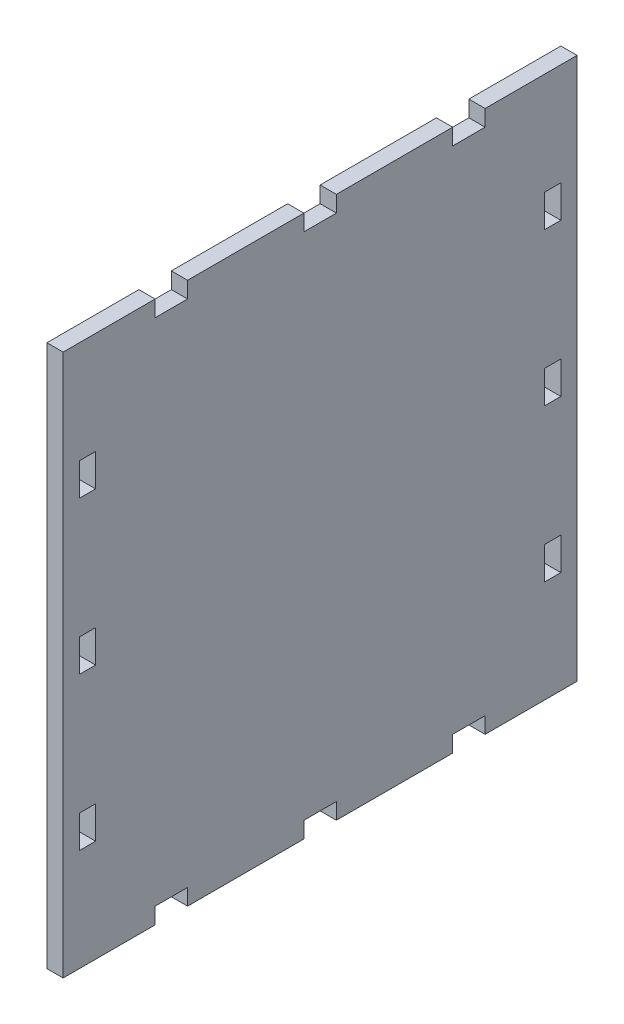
ISO-10303-21;
HEADER;
FILE_DESCRIPTION(('STEP AP214'),'2;1');
FILE_NAME('part.step','',(''),(''),'','','');
FILE_SCHEMA(('AUTOMOTIVE_DESIGN { 1 0 10303 214 1 1 1 1 }'));
ENDSEC;
DATA;
#1=APPLICATION_CONTEXT('core data for automotive mechanical design processes');
#2=APPLICATION_PROTOCOL_DEFINITION('international standard','automotive_design',2000,#1);
#3=PRODUCT_CONTEXT('',#1,'mechanical');
#4=PRODUCT('Part','Part','',(#3));
#5=PRODUCT_RELATED_PRODUCT_CATEGORY('part','',(#4));
#6=PRODUCT_DEFINITION_FORMATION('','',#4);
#7=PRODUCT_DEFINITION_CONTEXT('part definition',#1,'design');
#8=PRODUCT_DEFINITION('design','',#6,#7);
#9=PRODUCT_DEFINITION_SHAPE('','',#8);
#10=(LENGTH_UNIT() NAMED_UNIT(*) SI_UNIT(.MILLI.,.METRE.));
#11=(NAMED_UNIT(*) PLANE_ANGLE_UNIT() SI_UNIT($,.RADIAN.));
#12=(NAMED_UNIT(*) SI_UNIT($,.STERADIAN.) SOLID_ANGLE_UNIT());
#13=UNCERTAINTY_MEASURE_WITH_UNIT(LENGTH_MEASURE(1.E-05),#10,'distance_accuracy_value','');
#14=(GEOMETRIC_REPRESENTATION_CONTEXT(3) GLOBAL_UNCERTAINTY_ASSIGNED_CONTEXT((#13)) GLOBAL_UNIT_ASSIGNED_CONTEXT((#10,
#11,#12)) REPRESENTATION_CONTEXT('',''));
#15=CARTESIAN_POINT('',(0.,0.,0.));
#16=DIRECTION('',(0.,0.,1.));
#17=DIRECTION('',(1.,0.,0.));
#18=AXIS2_PLACEMENT_3D('',#15,#16,#17);
#19=CARTESIAN_POINT('',(-50.1,0.,0.));
#20=DIRECTION('',(-1.,0.,0.));
#21=DIRECTION('',(0.,0.,1.));
#22=AXIS2_PLACEMENT_3D('',#19,#20,#21);
#23=PLANE('',#22);
#24=DIRECTION('',(0.,1.,0.));
#25=VECTOR('',#24,1.);
#26=CARTESIAN_POINT('',(-50.1,-50.1,92.));
#27=LINE('',#26,#25);
#28=CARTESIAN_POINT('',(-50.1,-50.1,92.));
#29=VERTEX_POINT('',#28);
#30=CARTESIAN_POINT('',(-50.1,50.1,92.));
#31=VERTEX_POINT('',#30);
#32=EDGE_CURVE('E537',#29,#31,#27,.T.);
#33=ORIENTED_EDGE('',*,*,#32,.T.);
#34=DIRECTION('',(0.,0.,-1.));
#35=VECTOR('',#34,1.);
#36=CARTESIAN_POINT('',(-50.1,50.1,92.));
#37=LINE('',#36,#35);
#38=CARTESIAN_POINT('',(-50.1,50.1,75.));
#39=VERTEX_POINT('',#38);
#40=EDGE_CURVE('E540',#31,#39,#37,.T.);
#41=ORIENTED_EDGE('',*,*,#40,.T.);
#42=DIRECTION('',(0.,-1.,0.));
#43=VECTOR('',#42,1.);
#44=CARTESIAN_POINT('',(-50.1,50.1,75.));
#45=LINE('',#44,#43);
#46=CARTESIAN_POINT('',(-50.1,47.1,75.));
#47=VERTEX_POINT('',#46);
#48=EDGE_CURVE('E543',#39,#47,#45,.T.);
#49=ORIENTED_EDGE('',*,*,#48,.T.);
#50=DIRECTION('',(0.,0.,-1.));
#51=VECTOR('',#50,1.);
#52=CARTESIAN_POINT('',(-50.1,47.1,75.));
#53=LINE('',#52,#51);
#54=CARTESIAN_POINT('',(-50.1,47.1,69.));
#55=VERTEX_POINT('',#54);
#56=EDGE_CURVE('E545',#47,#55,#53,.T.);
#57=ORIENTED_EDGE('',*,*,#56,.T.);
#58=DIRECTION('',(0.,1.,0.));
#59=VECTOR('',#58,1.);
#60=CARTESIAN_POINT('',(-50.1,47.1,69.));
#61=LINE('',#60,#59);
#62=CARTESIAN_POINT('',(-50.1,50.1,69.));
#63=VERTEX_POINT('',#62);
#64=EDGE_CURVE('E547',#55,#63,#61,.T.);
#65=ORIENTED_EDGE('',*,*,#64,.T.);
#66=DIRECTION('',(0.,0.,-1.));
#67=VECTOR('',#66,1.);
#68=CARTESIAN_POINT('',(-50.1,50.1,69.));
#69=LINE('',#68,#67);
#70=CARTESIAN_POINT('',(-50.1,50.1,47.5));
#71=VERTEX_POINT('',#70);
#72=EDGE_CURVE('E549',#63,#71,#69,.T.);
#73=ORIENTED_EDGE('',*,*,#72,.T.);
#74=DIRECTION('',(0.,-1.,0.));
#75=VECTOR('',#74,1.);
#76=CARTESIAN_POINT('',(-50.1,50.1,47.5));
#77=LINE('',#76,#75);
#78=CARTESIAN_POINT('',(-50.1,47.1,47.5));
#79=VERTEX_POINT('',#78);
#80=EDGE_CURVE('E551',#71,#79,#77,.T.);
#81=ORIENTED_EDGE('',*,*,#80,.T.);
#82=DIRECTION('',(0.,0.,-1.));
#83=VECTOR('',#82,1.);
#84=CARTESIAN_POINT('',(-50.1,47.1,47.5));
#85=LINE('',#84,#83);
#86=CARTESIAN_POINT('',(-50.1,47.1,41.5));
#87=VERTEX_POINT('',#86);
#88=EDGE_CURVE('E553',#79,#87,#85,.T.);
#89=ORIENTED_EDGE('',*,*,#88,.T.);
#90=DIRECTION('',(0.,1.,0.));
#91=VECTOR('',#90,1.);
#92=CARTESIAN_POINT('',(-50.1,47.1,41.5));
#93=LINE('',#92,#91);
#94=CARTESIAN_POINT('',(-50.1,50.1,41.5));
#95=VERTEX_POINT('',#94);
#96=EDGE_CURVE('E555',#87,#95,#93,.T.);
#97=ORIENTED_EDGE('',*,*,#96,.T.);
#98=DIRECTION('',(0.,0.,-1.));
#99=VECTOR('',#98,1.);
#100=CARTESIAN_POINT('',(-50.1,50.1,41.5));
#101=LINE('',#100,#99);
#102=CARTESIAN_POINT('',(-50.1,50.1,20.));
#103=VERTEX_POINT('',#102);
#104=EDGE_CURVE('E557',#95,#103,#101,.T.);
#105=ORIENTED_EDGE('',*,*,#104,.T.);
#106=DIRECTION('',(0.,-1.,0.));
#107=VECTOR('',#106,1.);
#108=CARTESIAN_POINT('',(-50.1,50.1,20.));
#109=LINE('',#108,#107);
#110=CARTESIAN_POINT('',(-50.1,47.1,20.));
#111=VERTEX_POINT('',#110);
#112=EDGE_CURVE('E559',#103,#111,#109,.T.);
#113=ORIENTED_EDGE('',*,*,#112,.T.);
#114=DIRECTION('',(0.,0.,-1.));
#115=VECTOR('',#114,1.);
#116=CARTESIAN_POINT('',(-50.1,47.1,20.));
#117=LINE('',#116,#115);
#118=CARTESIAN_POINT('',(-50.1,47.1,14.));
#119=VERTEX_POINT('',#118);
#120=EDGE_CURVE('E561',#111,#119,#117,.T.);
#121=ORIENTED_EDGE('',*,*,#120,.T.);
#122=DIRECTION('',(0.,1.,0.));
#123=VECTOR('',#122,1.);
#124=CARTESIAN_POINT('',(-50.1,47.1,14.));
#125=LINE('',#124,#123);
#126=CARTESIAN_POINT('',(-50.1,50.1,14.));
#127=VERTEX_POINT('',#126);
#128=EDGE_CURVE('E563',#119,#127,#125,.T.);
#129=ORIENTED_EDGE('',*,*,#128,.T.);
#130=DIRECTION('',(0.,0.,-1.));
#131=VECTOR('',#130,1.);
#132=CARTESIAN_POINT('',(-50.1,50.1,14.));
#133=LINE('',#132,#131);
#134=CARTESIAN_POINT('',(-50.1,50.1,-3.));
#135=VERTEX_POINT('',#134);
#136=EDGE_CURVE('E565',#127,#135,#133,.T.);
#137=ORIENTED_EDGE('',*,*,#136,.T.);
#138=DIRECTION('',(0.,-1.,0.));
#139=VECTOR('',#138,1.);
#140=CARTESIAN_POINT('',(-50.1,50.1,-3.));
#141=LINE('',#140,#139);
#142=CARTESIAN_POINT('',(-50.1,-50.1,-3.));
#143=VERTEX_POINT('',#142);
#144=EDGE_CURVE('E567',#135,#143,#141,.T.);
#145=ORIENTED_EDGE('',*,*,#144,.T.);
#146=DIRECTION('',(0.,0.,1.));
#147=VECTOR('',#146,1.);
#148=CARTESIAN_POINT('',(-50.1,-50.1,-3.));
#149=LINE('',#148,#147);
#150=CARTESIAN_POINT('',(-50.1,-50.1,14.));
#151=VERTEX_POINT('',#150);
#152=EDGE_CURVE('E569',#143,#151,#149,.T.);
#153=ORIENTED_EDGE('',*,*,#152,.T.);
#154=DIRECTION('',(0.,1.,0.));
#155=VECTOR('',#154,1.);
#156=CARTESIAN_POINT('',(-50.1,-50.1,14.));
#157=LINE('',#156,#155);
#158=CARTESIAN_POINT('',(-50.1,-47.1,14.));
#159=VERTEX_POINT('',#158);
#160=EDGE_CURVE('E571',#151,#159,#157,.T.);
#161=ORIENTED_EDGE('',*,*,#160,.T.);
#162=DIRECTION('',(0.,0.,1.));
#163=VECTOR('',#162,1.);
#164=CARTESIAN_POINT('',(-50.1,-47.1,14.));
#165=LINE('',#164,#163);
#166=CARTESIAN_POINT('',(-50.1,-47.1,20.));
#167=VERTEX_POINT('',#166);
#168=EDGE_CURVE('E573',#159,#167,#165,.T.);
#169=ORIENTED_EDGE('',*,*,#168,.T.);
#170=DIRECTION('',(0.,-1.,0.));
#171=VECTOR('',#170,1.);
#172=CARTESIAN_POINT('',(-50.1,-47.1,20.));
#173=LINE('',#172,#171);
#174=CARTESIAN_POINT('',(-50.1,-50.1,20.));
#175=VERTEX_POINT('',#174);
#176=EDGE_CURVE('E575',#167,#175,#173,.T.);
#177=ORIENTED_EDGE('',*,*,#176,.T.);
#178=DIRECTION('',(0.,0.,1.));
#179=VECTOR('',#178,1.);
#180=CARTESIAN_POINT('',(-50.1,-50.1,20.));
#181=LINE('',#180,#179);
#182=CARTESIAN_POINT('',(-50.1,-50.1,41.5));
#183=VERTEX_POINT('',#182);
#184=EDGE_CURVE('E577',#175,#183,#181,.T.);
#185=ORIENTED_EDGE('',*,*,#184,.T.);
#186=DIRECTION('',(0.,1.,0.));
#187=VECTOR('',#186,1.);
#188=CARTESIAN_POINT('',(-50.1,-50.1,41.5));
#189=LINE('',#188,#187);
#190=CARTESIAN_POINT('',(-50.1,-47.1,41.5));
#191=VERTEX_POINT('',#190);
#192=EDGE_CURVE('E579',#183,#191,#189,.T.);
#193=ORIENTED_EDGE('',*,*,#192,.T.);
#194=DIRECTION('',(0.,0.,1.));
#195=VECTOR('',#194,1.);
#196=CARTESIAN_POINT('',(-50.1,-47.1,41.5));
#197=LINE('',#196,#195);
#198=CARTESIAN_POINT('',(-50.1,-47.1,47.5));
#199=VERTEX_POINT('',#198);
#200=EDGE_CURVE('E581',#191,#199,#197,.T.);
#201=ORIENTED_EDGE('',*,*,#200,.T.);
#202=DIRECTION('',(0.,-1.,0.));
#203=VECTOR('',#202,1.);
#204=CARTESIAN_POINT('',(-50.1,-47.1,47.5));
#205=LINE('',#204,#203);
#206=CARTESIAN_POINT('',(-50.1,-50.1,47.5));
#207=VERTEX_POINT('',#206);
#208=EDGE_CURVE('E583',#199,#207,#205,.T.);
#209=ORIENTED_EDGE('',*,*,#208,.T.);
#210=DIRECTION('',(0.,0.,1.));
#211=VECTOR('',#210,1.);
#212=CARTESIAN_POINT('',(-50.1,-50.1,47.5));
#213=LINE('',#212,#211);
#214=CARTESIAN_POINT('',(-50.1,-50.1,69.));
#215=VERTEX_POINT('',#214);
#216=EDGE_CURVE('E585',#207,#215,#213,.T.);
#217=ORIENTED_EDGE('',*,*,#216,.T.);
#218=DIRECTION('',(0.,1.,0.));
#219=VECTOR('',#218,1.);
#220=CARTESIAN_POINT('',(-50.1,-50.1,69.));
#221=LINE('',#220,#219);
#222=CARTESIAN_POINT('',(-50.1,-47.1,69.));
#223=VERTEX_POINT('',#222);
#224=EDGE_CURVE('E587',#215,#223,#221,.T.);
#225=ORIENTED_EDGE('',*,*,#224,.T.);
#226=DIRECTION('',(0.,0.,1.));
#227=VECTOR('',#226,1.);
#228=CARTESIAN_POINT('',(-50.1,-47.1,69.));
#229=LINE('',#228,#227);
#230=CARTESIAN_POINT('',(-50.1,-47.1,75.));
#231=VERTEX_POINT('',#230);
#232=EDGE_CURVE('E589',#223,#231,#229,.T.);
#233=ORIENTED_EDGE('',*,*,#232,.T.);
#234=DIRECTION('',(0.,-1.,0.));
#235=VECTOR('',#234,1.);
#236=CARTESIAN_POINT('',(-50.1,-47.1,75.));
#237=LINE('',#236,#235);
#238=CARTESIAN_POINT('',(-50.1,-50.1,75.));
#239=VERTEX_POINT('',#238);
#240=EDGE_CURVE('E591',#231,#239,#237,.T.);
#241=ORIENTED_EDGE('',*,*,#240,.T.);
#242=DIRECTION('',(0.,0.,1.));
#243=VECTOR('',#242,1.);
#244=CARTESIAN_POINT('',(-50.1,-50.1,75.));
#245=LINE('',#244,#243);
#246=EDGE_CURVE('E593',#239,#29,#245,.T.);
#247=ORIENTED_EDGE('',*,*,#246,.T.);
#248=EDGE_LOOP('',(#33,#41,#49,#57,#65,#73,#81,#89,#97,#105,#113,#121,#129,#137,#145,#153,#161,
#169,#177,#185,#193,#201,#209,#217,#225,#233,#241,#247));
#249=FACE_BOUND('',#248,.T.);
#250=DIRECTION('',(0.,0.,1.));
#251=VECTOR('',#250,1.);
#252=CARTESIAN_POINT('',(-50.1,25.2,0.));
#253=LINE('',#252,#251);
#254=CARTESIAN_POINT('',(-50.1,25.2,0.));
#255=VERTEX_POINT('',#254);
#256=CARTESIAN_POINT('',(-50.1,25.2,3.));
#257=VERTEX_POINT('',#256);
#258=EDGE_CURVE('E508',#255,#257,#253,.T.);
#259=ORIENTED_EDGE('',*,*,#258,.F.);
#260=DIRECTION('',(0.,-1.,0.));
#261=VECTOR('',#260,1.);
#262=CARTESIAN_POINT('',(-50.1,25.2,0.));
#263=LINE('',#262,#261);
#264=CARTESIAN_POINT('',(-50.1,31.2,0.));
#265=VERTEX_POINT('',#264);
#266=EDGE_CURVE('E506',#265,#255,#263,.T.);
#267=ORIENTED_EDGE('',*,*,#266,.F.);
#268=DIRECTION('',(0.,0.,-1.));
#269=VECTOR('',#268,1.);
#270=CARTESIAN_POINT('',(-50.1,31.2,0.));
#271=LINE('',#270,#269);
#272=CARTESIAN_POINT('',(-50.1,31.2,3.));
#273=VERTEX_POINT('',#272);
#274=EDGE_CURVE('E514',#273,#265,#271,.T.);
#275=ORIENTED_EDGE('',*,*,#274,.F.);
#276=DIRECTION('',(0.,1.,0.));
#277=VECTOR('',#276,1.);
#278=CARTESIAN_POINT('',(-50.1,25.2,3.));
#279=LINE('',#278,#277);
#280=EDGE_CURVE('E511',#257,#273,#279,.T.);
#281=ORIENTED_EDGE('',*,*,#280,.F.);
#282=EDGE_LOOP('',(#259,#267,#275,#281));
#283=FACE_BOUND('',#282,.T.);
#284=DIRECTION('',(0.,1.,0.));
#285=VECTOR('',#284,1.);
#286=CARTESIAN_POINT('',(-50.1,-3.00000000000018,3.));
#287=LINE('',#286,#285);
#288=CARTESIAN_POINT('',(-50.1,-3.00000000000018,3.));
#289=VERTEX_POINT('',#288);
#290=CARTESIAN_POINT('',(-50.1,2.99999999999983,3.));
#291=VERTEX_POINT('',#290);
#292=EDGE_CURVE('E477',#289,#291,#287,.T.);
#293=ORIENTED_EDGE('',*,*,#292,.F.);
#294=DIRECTION('',(0.,0.,1.));
#295=VECTOR('',#294,1.);
#296=CARTESIAN_POINT('',(-50.1,-3.00000000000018,3.));
#297=LINE('',#296,#295);
#298=CARTESIAN_POINT('',(-50.1,-3.00000000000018,0.));
#299=VERTEX_POINT('',#298);
#300=EDGE_CURVE('E475',#299,#289,#297,.T.);
#301=ORIENTED_EDGE('',*,*,#300,.F.);
#302=DIRECTION('',(0.,-1.,0.));
#303=VECTOR('',#302,1.);
#304=CARTESIAN_POINT('',(-50.1,-3.00000000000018,0.));
#305=LINE('',#304,#303);
#306=CARTESIAN_POINT('',(-50.1,2.99999999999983,0.));
#307=VERTEX_POINT('',#306);
#308=EDGE_CURVE('E483',#307,#299,#305,.T.);
#309=ORIENTED_EDGE('',*,*,#308,.F.);
#310=DIRECTION('',(0.,0.,-1.));
#311=VECTOR('',#310,1.);
#312=CARTESIAN_POINT('',(-50.1,2.99999999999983,3.));
#313=LINE('',#312,#311);
#314=EDGE_CURVE('E480',#291,#307,#313,.T.);
#315=ORIENTED_EDGE('',*,*,#314,.F.);
#316=EDGE_LOOP('',(#293,#301,#309,#315));
#317=FACE_BOUND('',#316,.T.);
#318=DIRECTION('',(0.,1.,0.));
#319=VECTOR('',#318,1.);
#320=CARTESIAN_POINT('',(-50.1,-31.2,3.));
#321=LINE('',#320,#319);
#322=CARTESIAN_POINT('',(-50.1,-31.2,3.));
#323=VERTEX_POINT('',#322);
#324=CARTESIAN_POINT('',(-50.1,-25.2,3.));
#325=VERTEX_POINT('',#324);
#326=EDGE_CURVE('E446',#323,#325,#321,.T.);
#327=ORIENTED_EDGE('',*,*,#326,.F.);
#328=DIRECTION('',(0.,0.,1.));
#329=VECTOR('',#328,1.);
#330=CARTESIAN_POINT('',(-50.1,-31.2,0.));
#331=LINE('',#330,#329);
#332=CARTESIAN_POINT('',(-50.1,-31.2,0.));
#333=VERTEX_POINT('',#332);
#334=EDGE_CURVE('E444',#333,#323,#331,.T.);
#335=ORIENTED_EDGE('',*,*,#334,.F.);
#336=DIRECTION('',(0.,-1.,0.));
#337=VECTOR('',#336,1.);
#338=CARTESIAN_POINT('',(-50.1,-31.2,0.));
#339=LINE('',#338,#337);
#340=CARTESIAN_POINT('',(-50.1,-25.2,0.));
#341=VERTEX_POINT('',#340);
#342=EDGE_CURVE('E452',#341,#333,#339,.T.);
#343=ORIENTED_EDGE('',*,*,#342,.F.);
#344=DIRECTION('',(0.,0.,-1.));
#345=VECTOR('',#344,1.);
#346=CARTESIAN_POINT('',(-50.1,-25.2,0.));
#347=LINE('',#346,#345);
#348=EDGE_CURVE('E449',#325,#341,#347,.T.);
#349=ORIENTED_EDGE('',*,*,#348,.F.);
#350=EDGE_LOOP('',(#327,#335,#343,#349));
#351=FACE_BOUND('',#350,.T.);
#352=DIRECTION('',(0.,0.,-1.));
#353=VECTOR('',#352,1.);
#354=CARTESIAN_POINT('',(-50.1,-25.2,89.));
#355=LINE('',#354,#353);
#356=CARTESIAN_POINT('',(-50.1,-25.2,89.));
#357=VERTEX_POINT('',#356);
#358=CARTESIAN_POINT('',(-50.1,-25.2,86.));
#359=VERTEX_POINT('',#358);
#360=EDGE_CURVE('E415',#357,#359,#355,.T.);
#361=ORIENTED_EDGE('',*,*,#360,.F.);
#362=DIRECTION('',(0.,1.,0.));
#363=VECTOR('',#362,1.);
#364=CARTESIAN_POINT('',(-50.1,-31.2,89.));
#365=LINE('',#364,#363);
#366=CARTESIAN_POINT('',(-50.1,-31.2,89.));
#367=VERTEX_POINT('',#366);
#368=EDGE_CURVE('E413',#367,#357,#365,.T.);
#369=ORIENTED_EDGE('',*,*,#368,.F.);
#370=DIRECTION('',(0.,0.,1.));
#371=VECTOR('',#370,1.);
#372=CARTESIAN_POINT('',(-50.1,-31.2,89.));
#373=LINE('',#372,#371);
#374=CARTESIAN_POINT('',(-50.1,-31.2,86.));
#375=VERTEX_POINT('',#374);
#376=EDGE_CURVE('E421',#375,#367,#373,.T.);
#377=ORIENTED_EDGE('',*,*,#376,.F.);
#378=DIRECTION('',(0.,-1.,0.));
#379=VECTOR('',#378,1.);
#380=CARTESIAN_POINT('',(-50.1,-31.2,86.));
#381=LINE('',#380,#379);
#382=EDGE_CURVE('E418',#359,#375,#381,.T.);
#383=ORIENTED_EDGE('',*,*,#382,.F.);
#384=EDGE_LOOP('',(#361,#369,#377,#383));
#385=FACE_BOUND('',#384,.T.);
#386=DIRECTION('',(0.,1.,0.));
#387=VECTOR('',#386,1.);
#388=CARTESIAN_POINT('',(-50.1,-3.00000000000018,89.));
#389=LINE('',#388,#387);
#390=CARTESIAN_POINT('',(-50.1,-3.00000000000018,89.));
#391=VERTEX_POINT('',#390);
#392=CARTESIAN_POINT('',(-50.1,2.99999999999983,89.));
#393=VERTEX_POINT('',#392);
#394=EDGE_CURVE('E384',#391,#393,#389,.T.);
#395=ORIENTED_EDGE('',*,*,#394,.F.);
#396=DIRECTION('',(0.,0.,1.));
#397=VECTOR('',#396,1.);
#398=CARTESIAN_POINT('',(-50.1,-3.00000000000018,86.));
#399=LINE('',#398,#397);
#400=CARTESIAN_POINT('',(-50.1,-3.00000000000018,86.));
#401=VERTEX_POINT('',#400);
#402=EDGE_CURVE('E382',#401,#391,#399,.T.);
#403=ORIENTED_EDGE('',*,*,#402,.F.);
#404=DIRECTION('',(0.,-1.,0.));
#405=VECTOR('',#404,1.);
#406=CARTESIAN_POINT('',(-50.1,-3.00000000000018,86.));
#407=LINE('',#406,#405);
#408=CARTESIAN_POINT('',(-50.1,2.99999999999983,86.));
#409=VERTEX_POINT('',#408);
#410=EDGE_CURVE('E390',#409,#401,#407,.T.);
#411=ORIENTED_EDGE('',*,*,#410,.F.);
#412=DIRECTION('',(0.,0.,-1.));
#413=VECTOR('',#412,1.);
#414=CARTESIAN_POINT('',(-50.1,2.99999999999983,86.));
#415=LINE('',#414,#413);
#416=EDGE_CURVE('E387',#393,#409,#415,.T.);
#417=ORIENTED_EDGE('',*,*,#416,.F.);
#418=EDGE_LOOP('',(#395,#403,#411,#417));
#419=FACE_BOUND('',#418,.T.);
#420=DIRECTION('',(0.,1.,0.));
#421=VECTOR('',#420,1.);
#422=CARTESIAN_POINT('',(-50.1,25.2,89.));
#423=LINE('',#422,#421);
#424=CARTESIAN_POINT('',(-50.1,25.2,89.));
#425=VERTEX_POINT('',#424);
#426=CARTESIAN_POINT('',(-50.1,31.2,89.));
#427=VERTEX_POINT('',#426);
#428=EDGE_CURVE('E354',#425,#427,#423,.T.);
#429=ORIENTED_EDGE('',*,*,#428,.F.);
#430=DIRECTION('',(0.,0.,1.));
#431=VECTOR('',#430,1.);
#432=CARTESIAN_POINT('',(-50.1,25.2,89.));
#433=LINE('',#432,#431);
#434=CARTESIAN_POINT('',(-50.1,25.2,86.));
#435=VERTEX_POINT('',#434);
#436=EDGE_CURVE('E346',#435,#425,#433,.T.);
#437=ORIENTED_EDGE('',*,*,#436,.F.);
#438=DIRECTION('',(0.,-1.,0.));
#439=VECTOR('',#438,1.);
#440=CARTESIAN_POINT('',(-50.1,25.2,86.));
#441=LINE('',#440,#439);
#442=CARTESIAN_POINT('',(-50.1,31.2,86.));
#443=VERTEX_POINT('',#442);
#444=EDGE_CURVE('E368',#443,#435,#441,.T.);
#445=ORIENTED_EDGE('',*,*,#444,.F.);
#446=DIRECTION('',(0.,0.,-1.));
#447=VECTOR('',#446,1.);
#448=CARTESIAN_POINT('',(-50.1,31.2,89.));
#449=LINE('',#448,#447);
#450=EDGE_CURVE('E366',#427,#443,#449,.T.);
#451=ORIENTED_EDGE('',*,*,#450,.F.);
#452=EDGE_LOOP('',(#429,#437,#445,#451));
#453=FACE_BOUND('',#452,.T.);
#454=ADVANCED_FACE('F17',(#249,#283,#317,#351,#385,#419,#453),#23,.T.);
#455=CARTESIAN_POINT('',(-47.1,0.,0.));
#456=DIRECTION('',(-1.,0.,0.));
#457=DIRECTION('',(0.,0.,1.));
#458=AXIS2_PLACEMENT_3D('',#455,#456,#457);
#459=PLANE('',#458);
#460=DIRECTION('',(0.,0.,1.));
#461=VECTOR('',#460,1.);
#462=CARTESIAN_POINT('',(-47.1,-3.00000000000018,86.));
#463=LINE('',#462,#461);
#464=CARTESIAN_POINT('',(-47.1,-3.00000000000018,86.));
#465=VERTEX_POINT('',#464);
#466=CARTESIAN_POINT('',(-47.1,-3.00000000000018,89.));
#467=VERTEX_POINT('',#466);
#468=EDGE_CURVE('E362',#465,#467,#463,.T.);
#469=ORIENTED_EDGE('',*,*,#468,.T.);
#470=DIRECTION('',(0.,1.,0.));
#471=VECTOR('',#470,1.);
#472=CARTESIAN_POINT('',(-47.1,-3.00000000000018,89.));
#473=LINE('',#472,#471);
#474=CARTESIAN_POINT('',(-47.1,2.99999999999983,89.));
#475=VERTEX_POINT('',#474);
#476=EDGE_CURVE('E395',#467,#475,#473,.T.);
#477=ORIENTED_EDGE('',*,*,#476,.T.);
#478=DIRECTION('',(0.,0.,-1.));
#479=VECTOR('',#478,1.);
#480=CARTESIAN_POINT('',(-47.1,2.99999999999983,86.));
#481=LINE('',#480,#479);
#482=CARTESIAN_POINT('',(-47.1,2.99999999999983,86.));
#483=VERTEX_POINT('',#482);
#484=EDGE_CURVE('E398',#475,#483,#481,.T.);
#485=ORIENTED_EDGE('',*,*,#484,.T.);
#486=DIRECTION('',(0.,-1.,0.));
#487=VECTOR('',#486,1.);
#488=CARTESIAN_POINT('',(-47.1,-3.00000000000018,86.));
#489=LINE('',#488,#487);
#490=EDGE_CURVE('E385',#483,#465,#489,.T.);
#491=ORIENTED_EDGE('',*,*,#490,.T.);
#492=EDGE_LOOP('',(#469,#477,#485,#491));
#493=FACE_BOUND('',#492,.T.);
#494=DIRECTION('',(0.,0.,1.));
#495=VECTOR('',#494,1.);
#496=CARTESIAN_POINT('',(-47.1,-31.2,0.));
#497=LINE('',#496,#495);
#498=CARTESIAN_POINT('',(-47.1,-31.2,0.));
#499=VERTEX_POINT('',#498);
#500=CARTESIAN_POINT('',(-47.1,-31.2,3.));
#501=VERTEX_POINT('',#500);
#502=EDGE_CURVE('E443',#499,#501,#497,.T.);
#503=ORIENTED_EDGE('',*,*,#502,.T.);
#504=DIRECTION('',(0.,1.,0.));
#505=VECTOR('',#504,1.);
#506=CARTESIAN_POINT('',(-47.1,-31.2,3.));
#507=LINE('',#506,#505);
#508=CARTESIAN_POINT('',(-47.1,-25.2,3.));
#509=VERTEX_POINT('',#508);
#510=EDGE_CURVE('E457',#501,#509,#507,.T.);
#511=ORIENTED_EDGE('',*,*,#510,.T.);
#512=DIRECTION('',(0.,0.,-1.));
#513=VECTOR('',#512,1.);
#514=CARTESIAN_POINT('',(-47.1,-25.2,0.));
#515=LINE('',#514,#513);
#516=CARTESIAN_POINT('',(-47.1,-25.2,0.));
#517=VERTEX_POINT('',#516);
#518=EDGE_CURVE('E460',#509,#517,#515,.T.);
#519=ORIENTED_EDGE('',*,*,#518,.T.);
#520=DIRECTION('',(0.,-1.,0.));
#521=VECTOR('',#520,1.);
#522=CARTESIAN_POINT('',(-47.1,-31.2,0.));
#523=LINE('',#522,#521);
#524=EDGE_CURVE('E447',#517,#499,#523,.T.);
#525=ORIENTED_EDGE('',*,*,#524,.T.);
#526=EDGE_LOOP('',(#503,#511,#519,#525));
#527=FACE_BOUND('',#526,.T.);
#528=DIRECTION('',(0.,-1.,0.));
#529=VECTOR('',#528,1.);
#530=CARTESIAN_POINT('',(-47.1,25.2,0.));
#531=LINE('',#530,#529);
#532=CARTESIAN_POINT('',(-47.1,31.2,0.));
#533=VERTEX_POINT('',#532);
#534=CARTESIAN_POINT('',(-47.1,25.2,0.));
#535=VERTEX_POINT('',#534);
#536=EDGE_CURVE('E505',#533,#535,#531,.T.);
#537=ORIENTED_EDGE('',*,*,#536,.T.);
#538=DIRECTION('',(0.,0.,1.));
#539=VECTOR('',#538,1.);
#540=CARTESIAN_POINT('',(-47.1,25.2,0.));
#541=LINE('',#540,#539);
#542=CARTESIAN_POINT('',(-47.1,25.2,3.));
#543=VERTEX_POINT('',#542);
#544=EDGE_CURVE('E519',#535,#543,#541,.T.);
#545=ORIENTED_EDGE('',*,*,#544,.T.);
#546=DIRECTION('',(0.,1.,0.));
#547=VECTOR('',#546,1.);
#548=CARTESIAN_POINT('',(-47.1,25.2,3.));
#549=LINE('',#548,#547);
#550=CARTESIAN_POINT('',(-47.1,31.2,3.));
#551=VERTEX_POINT('',#550);
#552=EDGE_CURVE('E522',#543,#551,#549,.T.);
#553=ORIENTED_EDGE('',*,*,#552,.T.);
#554=DIRECTION('',(0.,0.,-1.));
#555=VECTOR('',#554,1.);
#556=CARTESIAN_POINT('',(-47.1,31.2,0.));
#557=LINE('',#556,#555);
#558=EDGE_CURVE('E509',#551,#533,#557,.T.);
#559=ORIENTED_EDGE('',*,*,#558,.T.);
#560=EDGE_LOOP('',(#537,#545,#553,#559));
#561=FACE_BOUND('',#560,.T.);
#562=DIRECTION('',(0.,1.,0.));
#563=VECTOR('',#562,1.);
#564=CARTESIAN_POINT('',(-47.1,-50.1,92.));
#565=LINE('',#564,#563);
#566=CARTESIAN_POINT('',(-47.1,-50.1,92.));
#567=VERTEX_POINT('',#566);
#568=CARTESIAN_POINT('',(-47.1,50.1,92.));
#569=VERTEX_POINT('',#568);
#570=EDGE_CURVE('E536',#567,#569,#565,.T.);
#571=ORIENTED_EDGE('',*,*,#570,.F.);
#572=DIRECTION('',(0.,0.,1.));
#573=VECTOR('',#572,1.);
#574=CARTESIAN_POINT('',(-47.1,-50.1,75.));
#575=LINE('',#574,#573);
#576=CARTESIAN_POINT('',(-47.1,-50.1,75.));
#577=VERTEX_POINT('',#576);
#578=EDGE_CURVE('E541',#577,#567,#575,.T.);
#579=ORIENTED_EDGE('',*,*,#578,.F.);
#580=DIRECTION('',(0.,-1.,0.));
#581=VECTOR('',#580,1.);
#582=CARTESIAN_POINT('',(-47.1,-47.1,75.));
#583=LINE('',#582,#581);
#584=CARTESIAN_POINT('',(-47.1,-47.1,75.));
#585=VERTEX_POINT('',#584);
#586=EDGE_CURVE('E648',#585,#577,#583,.T.);
#587=ORIENTED_EDGE('',*,*,#586,.F.);
#588=DIRECTION('',(0.,0.,1.));
#589=VECTOR('',#588,1.);
#590=CARTESIAN_POINT('',(-47.1,-47.1,69.));
#591=LINE('',#590,#589);
#592=CARTESIAN_POINT('',(-47.1,-47.1,69.));
#593=VERTEX_POINT('',#592);
#594=EDGE_CURVE('E646',#593,#585,#591,.T.);
#595=ORIENTED_EDGE('',*,*,#594,.F.);
#596=DIRECTION('',(0.,1.,0.));
#597=VECTOR('',#596,1.);
#598=CARTESIAN_POINT('',(-47.1,-50.1,69.));
#599=LINE('',#598,#597);
#600=CARTESIAN_POINT('',(-47.1,-50.1,69.));
#601=VERTEX_POINT('',#600);
#602=EDGE_CURVE('E644',#601,#593,#599,.T.);
#603=ORIENTED_EDGE('',*,*,#602,.F.);
#604=DIRECTION('',(0.,0.,1.));
#605=VECTOR('',#604,1.);
#606=CARTESIAN_POINT('',(-47.1,-50.1,47.5));
#607=LINE('',#606,#605);
#608=CARTESIAN_POINT('',(-47.1,-50.1,47.5));
#609=VERTEX_POINT('',#608);
#610=EDGE_CURVE('E642',#609,#601,#607,.T.);
#611=ORIENTED_EDGE('',*,*,#610,.F.);
#612=DIRECTION('',(0.,-1.,0.));
#613=VECTOR('',#612,1.);
#614=CARTESIAN_POINT('',(-47.1,-47.1,47.5));
#615=LINE('',#614,#613);
#616=CARTESIAN_POINT('',(-47.1,-47.1,47.5));
#617=VERTEX_POINT('',#616);
#618=EDGE_CURVE('E640',#617,#609,#615,.T.);
#619=ORIENTED_EDGE('',*,*,#618,.F.);
#620=DIRECTION('',(0.,0.,1.));
#621=VECTOR('',#620,1.);
#622=CARTESIAN_POINT('',(-47.1,-47.1,41.5));
#623=LINE('',#622,#621);
#624=CARTESIAN_POINT('',(-47.1,-47.1,41.5));
#625=VERTEX_POINT('',#624);
#626=EDGE_CURVE('E638',#625,#617,#623,.T.);
#627=ORIENTED_EDGE('',*,*,#626,.F.);
#628=DIRECTION('',(0.,1.,0.));
#629=VECTOR('',#628,1.);
#630=CARTESIAN_POINT('',(-47.1,-50.1,41.5));
#631=LINE('',#630,#629);
#632=CARTESIAN_POINT('',(-47.1,-50.1,41.5));
#633=VERTEX_POINT('',#632);
#634=EDGE_CURVE('E636',#633,#625,#631,.T.);
#635=ORIENTED_EDGE('',*,*,#634,.F.);
#636=DIRECTION('',(0.,0.,1.));
#637=VECTOR('',#636,1.);
#638=CARTESIAN_POINT('',(-47.1,-50.1,20.));
#639=LINE('',#638,#637);
#640=CARTESIAN_POINT('',(-47.1,-50.1,20.));
#641=VERTEX_POINT('',#640);
#642=EDGE_CURVE('E634',#641,#633,#639,.T.);
#643=ORIENTED_EDGE('',*,*,#642,.F.);
#644=DIRECTION('',(0.,-1.,0.));
#645=VECTOR('',#644,1.);
#646=CARTESIAN_POINT('',(-47.1,-47.1,20.));
#647=LINE('',#646,#645);
#648=CARTESIAN_POINT('',(-47.1,-47.1,20.));
#649=VERTEX_POINT('',#648);
#650=EDGE_CURVE('E632',#649,#641,#647,.T.);
#651=ORIENTED_EDGE('',*,*,#650,.F.);
#652=DIRECTION('',(0.,0.,1.));
#653=VECTOR('',#652,1.);
#654=CARTESIAN_POINT('',(-47.1,-47.1,14.));
#655=LINE('',#654,#653);
#656=CARTESIAN_POINT('',(-47.1,-47.1,14.));
#657=VERTEX_POINT('',#656);
#658=EDGE_CURVE('E630',#657,#649,#655,.T.);
#659=ORIENTED_EDGE('',*,*,#658,.F.);
#660=DIRECTION('',(0.,1.,0.));
#661=VECTOR('',#660,1.);
#662=CARTESIAN_POINT('',(-47.1,-50.1,14.));
#663=LINE('',#662,#661);
#664=CARTESIAN_POINT('',(-47.1,-50.1,14.));
#665=VERTEX_POINT('',#664);
#666=EDGE_CURVE('E628',#665,#657,#663,.T.);
#667=ORIENTED_EDGE('',*,*,#666,.F.);
#668=DIRECTION('',(0.,0.,1.));
#669=VECTOR('',#668,1.);
#670=CARTESIAN_POINT('',(-47.1,-50.1,-3.));
#671=LINE('',#670,#669);
#672=CARTESIAN_POINT('',(-47.1,-50.1,-3.));
#673=VERTEX_POINT('',#672);
#674=EDGE_CURVE('E626',#673,#665,#671,.T.);
#675=ORIENTED_EDGE('',*,*,#674,.F.);
#676=DIRECTION('',(0.,-1.,0.));
#677=VECTOR('',#676,1.);
#678=CARTESIAN_POINT('',(-47.1,50.1,-3.));
#679=LINE('',#678,#677);
#680=CARTESIAN_POINT('',(-47.1,50.1,-3.));
#681=VERTEX_POINT('',#680);
#682=EDGE_CURVE('E624',#681,#673,#679,.T.);
#683=ORIENTED_EDGE('',*,*,#682,.F.);
#684=DIRECTION('',(0.,0.,-1.));
#685=VECTOR('',#684,1.);
#686=CARTESIAN_POINT('',(-47.1,50.1,14.));
#687=LINE('',#686,#685);
#688=CARTESIAN_POINT('',(-47.1,50.1,14.));
#689=VERTEX_POINT('',#688);
#690=EDGE_CURVE('E622',#689,#681,#687,.T.);
#691=ORIENTED_EDGE('',*,*,#690,.F.);
#692=DIRECTION('',(0.,1.,0.));
#693=VECTOR('',#692,1.);
#694=CARTESIAN_POINT('',(-47.1,47.1,14.));
#695=LINE('',#694,#693);
#696=CARTESIAN_POINT('',(-47.1,47.1,14.));
#697=VERTEX_POINT('',#696);
#698=EDGE_CURVE('E620',#697,#689,#695,.T.);
#699=ORIENTED_EDGE('',*,*,#698,.F.);
#700=DIRECTION('',(0.,0.,-1.));
#701=VECTOR('',#700,1.);
#702=CARTESIAN_POINT('',(-47.1,47.1,20.));
#703=LINE('',#702,#701);
#704=CARTESIAN_POINT('',(-47.1,47.1,20.));
#705=VERTEX_POINT('',#704);
#706=EDGE_CURVE('E618',#705,#697,#703,.T.);
#707=ORIENTED_EDGE('',*,*,#706,.F.);
#708=DIRECTION('',(0.,-1.,0.));
#709=VECTOR('',#708,1.);
#710=CARTESIAN_POINT('',(-47.1,50.1,20.));
#711=LINE('',#710,#709);
#712=CARTESIAN_POINT('',(-47.1,50.1,20.));
#713=VERTEX_POINT('',#712);
#714=EDGE_CURVE('E616',#713,#705,#711,.T.);
#715=ORIENTED_EDGE('',*,*,#714,.F.);
#716=DIRECTION('',(0.,0.,-1.));
#717=VECTOR('',#716,1.);
#718=CARTESIAN_POINT('',(-47.1,50.1,41.5));
#719=LINE('',#718,#717);
#720=CARTESIAN_POINT('',(-47.1,50.1,41.5));
#721=VERTEX_POINT('',#720);
#722=EDGE_CURVE('E614',#721,#713,#719,.T.);
#723=ORIENTED_EDGE('',*,*,#722,.F.);
#724=DIRECTION('',(0.,1.,0.));
#725=VECTOR('',#724,1.);
#726=CARTESIAN_POINT('',(-47.1,47.1,41.5));
#727=LINE('',#726,#725);
#728=CARTESIAN_POINT('',(-47.1,47.1,41.5));
#729=VERTEX_POINT('',#728);
#730=EDGE_CURVE('E612',#729,#721,#727,.T.);
#731=ORIENTED_EDGE('',*,*,#730,.F.);
#732=DIRECTION('',(0.,0.,-1.));
#733=VECTOR('',#732,1.);
#734=CARTESIAN_POINT('',(-47.1,47.1,47.5));
#735=LINE('',#734,#733);
#736=CARTESIAN_POINT('',(-47.1,47.1,47.5));
#737=VERTEX_POINT('',#736);
#738=EDGE_CURVE('E610',#737,#729,#735,.T.);
#739=ORIENTED_EDGE('',*,*,#738,.F.);
#740=DIRECTION('',(0.,-1.,0.));
#741=VECTOR('',#740,1.);
#742=CARTESIAN_POINT('',(-47.1,50.1,47.5));
#743=LINE('',#742,#741);
#744=CARTESIAN_POINT('',(-47.1,50.1,47.5));
#745=VERTEX_POINT('',#744);
#746=EDGE_CURVE('E608',#745,#737,#743,.T.);
#747=ORIENTED_EDGE('',*,*,#746,.F.);
#748=DIRECTION('',(0.,0.,-1.));
#749=VECTOR('',#748,1.);
#750=CARTESIAN_POINT('',(-47.1,50.1,69.));
#751=LINE('',#750,#749);
#752=CARTESIAN_POINT('',(-47.1,50.1,69.));
#753=VERTEX_POINT('',#752);
#754=EDGE_CURVE('E606',#753,#745,#751,.T.);
#755=ORIENTED_EDGE('',*,*,#754,.F.);
#756=DIRECTION('',(0.,1.,0.));
#757=VECTOR('',#756,1.);
#758=CARTESIAN_POINT('',(-47.1,47.1,69.));
#759=LINE('',#758,#757);
#760=CARTESIAN_POINT('',(-47.1,47.1,69.));
#761=VERTEX_POINT('',#760);
#762=EDGE_CURVE('E604',#761,#753,#759,.T.);
#763=ORIENTED_EDGE('',*,*,#762,.F.);
#764=DIRECTION('',(0.,0.,-1.));
#765=VECTOR('',#764,1.);
#766=CARTESIAN_POINT('',(-47.1,47.1,75.));
#767=LINE('',#766,#765);
#768=CARTESIAN_POINT('',(-47.1,47.1,75.));
#769=VERTEX_POINT('',#768);
#770=EDGE_CURVE('E602',#769,#761,#767,.T.);
#771=ORIENTED_EDGE('',*,*,#770,.F.);
#772=DIRECTION('',(0.,-1.,0.));
#773=VECTOR('',#772,1.);
#774=CARTESIAN_POINT('',(-47.1,50.1,75.));
#775=LINE('',#774,#773);
#776=CARTESIAN_POINT('',(-47.1,50.1,75.));
#777=VERTEX_POINT('',#776);
#778=EDGE_CURVE('E600',#777,#769,#775,.T.);
#779=ORIENTED_EDGE('',*,*,#778,.F.);
#780=DIRECTION('',(0.,0.,-1.));
#781=VECTOR('',#780,1.);
#782=CARTESIAN_POINT('',(-47.1,50.1,92.));
#783=LINE('',#782,#781);
#784=EDGE_CURVE('E598',#569,#777,#783,.T.);
#785=ORIENTED_EDGE('',*,*,#784,.F.);
#786=EDGE_LOOP('',(#571,#579,#587,#595,#603,#611,#619,#627,#635,#643,#651,#659,#667,#675,#683,
#691,#699,#707,#715,#723,#731,#739,#747,#755,#763,#771,#779,#785));
#787=FACE_BOUND('',#786,.T.);
#788=DIRECTION('',(0.,0.,1.));
#789=VECTOR('',#788,1.);
#790=CARTESIAN_POINT('',(-47.1,-3.00000000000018,3.));
#791=LINE('',#790,#789);
#792=CARTESIAN_POINT('',(-47.1,-3.00000000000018,0.));
#793=VERTEX_POINT('',#792);
#794=CARTESIAN_POINT('',(-47.1,-3.00000000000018,3.));
#795=VERTEX_POINT('',#794);
#796=EDGE_CURVE('E474',#793,#795,#791,.T.);
#797=ORIENTED_EDGE('',*,*,#796,.T.);
#798=DIRECTION('',(0.,1.,0.));
#799=VECTOR('',#798,1.);
#800=CARTESIAN_POINT('',(-47.1,-3.00000000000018,3.));
#801=LINE('',#800,#799);
#802=CARTESIAN_POINT('',(-47.1,2.99999999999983,3.));
#803=VERTEX_POINT('',#802);
#804=EDGE_CURVE('E488',#795,#803,#801,.T.);
#805=ORIENTED_EDGE('',*,*,#804,.T.);
#806=DIRECTION('',(0.,0.,-1.));
#807=VECTOR('',#806,1.);
#808=CARTESIAN_POINT('',(-47.1,2.99999999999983,3.));
#809=LINE('',#808,#807);
#810=CARTESIAN_POINT('',(-47.1,2.99999999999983,0.));
#811=VERTEX_POINT('',#810);
#812=EDGE_CURVE('E491',#803,#811,#809,.T.);
#813=ORIENTED_EDGE('',*,*,#812,.T.);
#814=DIRECTION('',(0.,-1.,0.));
#815=VECTOR('',#814,1.);
#816=CARTESIAN_POINT('',(-47.1,-3.00000000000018,0.));
#817=LINE('',#816,#815);
#818=EDGE_CURVE('E478',#811,#793,#817,.T.);
#819=ORIENTED_EDGE('',*,*,#818,.T.);
#820=EDGE_LOOP('',(#797,#805,#813,#819));
#821=FACE_BOUND('',#820,.T.);
#822=DIRECTION('',(0.,1.,0.));
#823=VECTOR('',#822,1.);
#824=CARTESIAN_POINT('',(-47.1,-31.2,89.));
#825=LINE('',#824,#823);
#826=CARTESIAN_POINT('',(-47.1,-31.2,89.));
#827=VERTEX_POINT('',#826);
#828=CARTESIAN_POINT('',(-47.1,-25.2,89.));
#829=VERTEX_POINT('',#828);
#830=EDGE_CURVE('E412',#827,#829,#825,.T.);
#831=ORIENTED_EDGE('',*,*,#830,.T.);
#832=DIRECTION('',(0.,0.,-1.));
#833=VECTOR('',#832,1.);
#834=CARTESIAN_POINT('',(-47.1,-25.2,89.));
#835=LINE('',#834,#833);
#836=CARTESIAN_POINT('',(-47.1,-25.2,86.));
#837=VERTEX_POINT('',#836);
#838=EDGE_CURVE('E426',#829,#837,#835,.T.);
#839=ORIENTED_EDGE('',*,*,#838,.T.);
#840=DIRECTION('',(0.,-1.,0.));
#841=VECTOR('',#840,1.);
#842=CARTESIAN_POINT('',(-47.1,-31.2,86.));
#843=LINE('',#842,#841);
#844=CARTESIAN_POINT('',(-47.1,-31.2,86.));
#845=VERTEX_POINT('',#844);
#846=EDGE_CURVE('E429',#837,#845,#843,.T.);
#847=ORIENTED_EDGE('',*,*,#846,.T.);
#848=DIRECTION('',(0.,0.,1.));
#849=VECTOR('',#848,1.);
#850=CARTESIAN_POINT('',(-47.1,-31.2,89.));
#851=LINE('',#850,#849);
#852=EDGE_CURVE('E416',#845,#827,#851,.T.);
#853=ORIENTED_EDGE('',*,*,#852,.T.);
#854=EDGE_LOOP('',(#831,#839,#847,#853));
#855=FACE_BOUND('',#854,.T.);
#856=DIRECTION('',(0.,0.,1.));
#857=VECTOR('',#856,1.);
#858=CARTESIAN_POINT('',(-47.1,25.2,89.));
#859=LINE('',#858,#857);
#860=CARTESIAN_POINT('',(-47.1,25.2,86.));
#861=VERTEX_POINT('',#860);
#862=CARTESIAN_POINT('',(-47.1,25.2,89.));
#863=VERTEX_POINT('',#862);
#864=EDGE_CURVE('E40',#861,#863,#859,.T.);
#865=ORIENTED_EDGE('',*,*,#864,.T.);
#866=DIRECTION('',(0.,1.,0.));
#867=VECTOR('',#866,1.);
#868=CARTESIAN_POINT('',(-47.1,25.2,89.));
#869=LINE('',#868,#867);
#870=CARTESIAN_POINT('',(-47.1,31.2,89.));
#871=VERTEX_POINT('',#870);
#872=EDGE_CURVE('E361',#863,#871,#869,.T.);
#873=ORIENTED_EDGE('',*,*,#872,.T.);
#874=DIRECTION('',(0.,0.,-1.));
#875=VECTOR('',#874,1.);
#876=CARTESIAN_POINT('',(-47.1,31.2,89.));
#877=LINE('',#876,#875);
#878=CARTESIAN_POINT('',(-47.1,31.2,86.));
#879=VERTEX_POINT('',#878);
#880=EDGE_CURVE('E374',#871,#879,#877,.T.);
#881=ORIENTED_EDGE('',*,*,#880,.T.);
#882=DIRECTION('',(0.,-1.,0.));
#883=VECTOR('',#882,1.);
#884=CARTESIAN_POINT('',(-47.1,25.2,86.));
#885=LINE('',#884,#883);
#886=EDGE_CURVE('E355',#879,#861,#885,.T.);
#887=ORIENTED_EDGE('',*,*,#886,.T.);
#888=EDGE_LOOP('',(#865,#873,#881,#887));
#889=FACE_BOUND('',#888,.T.);
#890=ADVANCED_FACE('F738',(#493,#527,#561,#787,#821,#855,#889),#459,.F.);
#891=CARTESIAN_POINT('',(-50.1,-50.1,92.));
#892=DIRECTION('',(0.,0.,-1.));
#893=DIRECTION('',(-1.,0.,0.));
#894=AXIS2_PLACEMENT_3D('',#891,#892,#893);
#895=PLANE('',#894);
#896=ORIENTED_EDGE('',*,*,#570,.T.);
#897=DIRECTION('',(1.,0.,0.));
#898=VECTOR('',#897,1.);
#899=CARTESIAN_POINT('',(-50.1,50.1,92.));
#900=LINE('',#899,#898);
#901=EDGE_CURVE('E11',#31,#569,#900,.T.);
#902=ORIENTED_EDGE('',*,*,#901,.F.);
#903=ORIENTED_EDGE('',*,*,#32,.F.);
#904=DIRECTION('',(1.,0.,0.));
#905=VECTOR('',#904,1.);
#906=CARTESIAN_POINT('',(-50.1,-50.1,92.));
#907=LINE('',#906,#905);
#908=EDGE_CURVE('E595',#29,#567,#907,.T.);
#909=ORIENTED_EDGE('',*,*,#908,.T.);
#910=EDGE_LOOP('',(#896,#902,#903,#909));
#911=FACE_BOUND('',#910,.T.);
#912=ADVANCED_FACE('F19',(#911),#895,.F.);
#913=CARTESIAN_POINT('',(-50.1,50.1,92.));
#914=DIRECTION('',(0.,-1.,0.));
#915=DIRECTION('',(0.,0.,-1.));
#916=AXIS2_PLACEMENT_3D('',#913,#914,#915);
#917=PLANE('',#916);
#918=ORIENTED_EDGE('',*,*,#784,.T.);
#919=DIRECTION('',(1.,0.,0.));
#920=VECTOR('',#919,1.);
#921=CARTESIAN_POINT('',(-50.1,50.1,75.));
#922=LINE('',#921,#920);
#923=EDGE_CURVE('E25',#39,#777,#922,.T.);
#924=ORIENTED_EDGE('',*,*,#923,.F.);
#925=ORIENTED_EDGE('',*,*,#40,.F.);
#926=ORIENTED_EDGE('',*,*,#901,.T.);
#927=EDGE_LOOP('',(#918,#924,#925,#926));
#928=FACE_BOUND('',#927,.T.);
#929=ADVANCED_FACE('F756',(#928),#917,.F.);
#930=CARTESIAN_POINT('',(-50.1,50.1,75.));
#931=DIRECTION('',(0.,0.,1.));
#932=DIRECTION('',(1.,0.,0.));
#933=AXIS2_PLACEMENT_3D('',#930,#931,#932);
#934=PLANE('',#933);
#935=ORIENTED_EDGE('',*,*,#778,.T.);
#936=DIRECTION('',(1.,0.,0.));
#937=VECTOR('',#936,1.);
#938=CARTESIAN_POINT('',(-50.1,47.1,75.));
#939=LINE('',#938,#937);
#940=EDGE_CURVE('E725',#47,#769,#939,.T.);
#941=ORIENTED_EDGE('',*,*,#940,.F.);
#942=ORIENTED_EDGE('',*,*,#48,.F.);
#943=ORIENTED_EDGE('',*,*,#923,.T.);
#944=EDGE_LOOP('',(#935,#941,#942,#943));
#945=FACE_BOUND('',#944,.T.);
#946=ADVANCED_FACE('F732',(#945),#934,.F.);
#947=CARTESIAN_POINT('',(-50.1,47.1,75.));
#948=DIRECTION('',(0.,-1.,0.));
#949=DIRECTION('',(0.,0.,-1.));
#950=AXIS2_PLACEMENT_3D('',#947,#948,#949);
#951=PLANE('',#950);
#952=ORIENTED_EDGE('',*,*,#770,.T.);
#953=DIRECTION('',(1.,0.,0.));
#954=VECTOR('',#953,1.);
#955=CARTESIAN_POINT('',(-50.1,47.1,69.));
#956=LINE('',#955,#954);
#957=EDGE_CURVE('E722',#55,#761,#956,.T.);
#958=ORIENTED_EDGE('',*,*,#957,.F.);
#959=ORIENTED_EDGE('',*,*,#56,.F.);
#960=ORIENTED_EDGE('',*,*,#940,.T.);
#961=EDGE_LOOP('',(#952,#958,#959,#960));
#962=FACE_BOUND('',#961,.T.);
#963=ADVANCED_FACE('F744',(#962),#951,.F.);
#964=CARTESIAN_POINT('',(-50.1,47.1,69.));
#965=DIRECTION('',(0.,0.,-1.));
#966=DIRECTION('',(-1.,0.,0.));
#967=AXIS2_PLACEMENT_3D('',#964,#965,#966);
#968=PLANE('',#967);
#969=ORIENTED_EDGE('',*,*,#762,.T.);
#970=DIRECTION('',(1.,0.,0.));
#971=VECTOR('',#970,1.);
#972=CARTESIAN_POINT('',(-50.1,50.1,69.));
#973=LINE('',#972,#971);
#974=EDGE_CURVE('E719',#63,#753,#973,.T.);
#975=ORIENTED_EDGE('',*,*,#974,.F.);
#976=ORIENTED_EDGE('',*,*,#64,.F.);
#977=ORIENTED_EDGE('',*,*,#957,.T.);
#978=EDGE_LOOP('',(#969,#975,#976,#977));
#979=FACE_BOUND('',#978,.T.);
#980=ADVANCED_FACE('F748',(#979),#968,.F.);
#981=CARTESIAN_POINT('',(-50.1,50.1,69.));
#982=DIRECTION('',(0.,-1.,0.));
#983=DIRECTION('',(0.,0.,-1.));
#984=AXIS2_PLACEMENT_3D('',#981,#982,#983);
#985=PLANE('',#984);
#986=ORIENTED_EDGE('',*,*,#754,.T.);
#987=DIRECTION('',(1.,0.,0.));
#988=VECTOR('',#987,1.);
#989=CARTESIAN_POINT('',(-50.1,50.1,47.5));
#990=LINE('',#989,#988);
#991=EDGE_CURVE('E716',#71,#745,#990,.T.);
#992=ORIENTED_EDGE('',*,*,#991,.F.);
#993=ORIENTED_EDGE('',*,*,#72,.F.);
#994=ORIENTED_EDGE('',*,*,#974,.T.);
#995=EDGE_LOOP('',(#986,#992,#993,#994));
#996=FACE_BOUND('',#995,.T.);
#997=ADVANCED_FACE('F869',(#996),#985,.F.);
#998=CARTESIAN_POINT('',(-50.1,50.1,47.5));
#999=DIRECTION('',(0.,0.,1.));
#1000=DIRECTION('',(0.,-1.,0.));
#1001=AXIS2_PLACEMENT_3D('',#998,#999,#1000);
#1002=PLANE('',#1001);
#1003=ORIENTED_EDGE('',*,*,#746,.T.);
#1004=DIRECTION('',(1.,0.,0.));
#1005=VECTOR('',#1004,1.);
#1006=CARTESIAN_POINT('',(-50.1,47.1,47.5));
#1007=LINE('',#1006,#1005);
#1008=EDGE_CURVE('E713',#79,#737,#1007,.T.);
#1009=ORIENTED_EDGE('',*,*,#1008,.F.);
#1010=ORIENTED_EDGE('',*,*,#80,.F.);
#1011=ORIENTED_EDGE('',*,*,#991,.T.);
#1012=EDGE_LOOP('',(#1003,#1009,#1010,#1011));
#1013=FACE_BOUND('',#1012,.T.);
#1014=ADVANCED_FACE('F866',(#1013),#1002,.F.);
#1015=CARTESIAN_POINT('',(-50.1,47.1,47.5));
#1016=DIRECTION('',(0.,-1.,0.));
#1017=DIRECTION('',(0.,0.,-1.));
#1018=AXIS2_PLACEMENT_3D('',#1015,#1016,#1017);
#1019=PLANE('',#1018);
#1020=ORIENTED_EDGE('',*,*,#738,.T.);
#1021=DIRECTION('',(1.,0.,0.));
#1022=VECTOR('',#1021,1.);
#1023=CARTESIAN_POINT('',(-50.1,47.1,41.5));
#1024=LINE('',#1023,#1022);
#1025=EDGE_CURVE('E710',#87,#729,#1024,.T.);
#1026=ORIENTED_EDGE('',*,*,#1025,.F.);
#1027=ORIENTED_EDGE('',*,*,#88,.F.);
#1028=ORIENTED_EDGE('',*,*,#1008,.T.);
#1029=EDGE_LOOP('',(#1020,#1026,#1027,#1028));
#1030=FACE_BOUND('',#1029,.T.);
#1031=ADVANCED_FACE('F862',(#1030),#1019,.F.);
#1032=CARTESIAN_POINT('',(-50.1,47.1,41.5));
#1033=DIRECTION('',(0.,0.,-1.));
#1034=DIRECTION('',(0.,1.,0.));
#1035=AXIS2_PLACEMENT_3D('',#1032,#1033,#1034);
#1036=PLANE('',#1035);
#1037=ORIENTED_EDGE('',*,*,#730,.T.);
#1038=DIRECTION('',(1.,0.,0.));
#1039=VECTOR('',#1038,1.);
#1040=CARTESIAN_POINT('',(-50.1,50.1,41.5));
#1041=LINE('',#1040,#1039);
#1042=EDGE_CURVE('E707',#95,#721,#1041,.T.);
#1043=ORIENTED_EDGE('',*,*,#1042,.F.);
#1044=ORIENTED_EDGE('',*,*,#96,.F.);
#1045=ORIENTED_EDGE('',*,*,#1025,.T.);
#1046=EDGE_LOOP('',(#1037,#1043,#1044,#1045));
#1047=FACE_BOUND('',#1046,.T.);
#1048=ADVANCED_FACE('F858',(#1047),#1036,.F.);
#1049=CARTESIAN_POINT('',(-50.1,50.1,41.5));
#1050=DIRECTION('',(0.,-1.,0.));
#1051=DIRECTION('',(0.,0.,-1.));
#1052=AXIS2_PLACEMENT_3D('',#1049,#1050,#1051);
#1053=PLANE('',#1052);
#1054=ORIENTED_EDGE('',*,*,#722,.T.);
#1055=DIRECTION('',(1.,0.,0.));
#1056=VECTOR('',#1055,1.);
#1057=CARTESIAN_POINT('',(-50.1,50.1,20.));
#1058=LINE('',#1057,#1056);
#1059=EDGE_CURVE('E704',#103,#713,#1058,.T.);
#1060=ORIENTED_EDGE('',*,*,#1059,.F.);
#1061=ORIENTED_EDGE('',*,*,#104,.F.);
#1062=ORIENTED_EDGE('',*,*,#1042,.T.);
#1063=EDGE_LOOP('',(#1054,#1060,#1061,#1062));
#1064=FACE_BOUND('',#1063,.T.);
#1065=ADVANCED_FACE('F853',(#1064),#1053,.F.);
#1066=CARTESIAN_POINT('',(-50.1,50.1,20.));
#1067=DIRECTION('',(0.,0.,1.));
#1068=DIRECTION('',(1.,0.,0.));
#1069=AXIS2_PLACEMENT_3D('',#1066,#1067,#1068);
#1070=PLANE('',#1069);
#1071=ORIENTED_EDGE('',*,*,#714,.T.);
#1072=DIRECTION('',(1.,0.,0.));
#1073=VECTOR('',#1072,1.);
#1074=CARTESIAN_POINT('',(-50.1,47.1,20.));
#1075=LINE('',#1074,#1073);
#1076=EDGE_CURVE('E701',#111,#705,#1075,.T.);
#1077=ORIENTED_EDGE('',*,*,#1076,.F.);
#1078=ORIENTED_EDGE('',*,*,#112,.F.);
#1079=ORIENTED_EDGE('',*,*,#1059,.T.);
#1080=EDGE_LOOP('',(#1071,#1077,#1078,#1079));
#1081=FACE_BOUND('',#1080,.T.);
#1082=ADVANCED_FACE('F847',(#1081),#1070,.F.);
#1083=CARTESIAN_POINT('',(-50.1,47.1,20.));
#1084=DIRECTION('',(0.,-1.,0.));
#1085=DIRECTION('',(0.,0.,-1.));
#1086=AXIS2_PLACEMENT_3D('',#1083,#1084,#1085);
#1087=PLANE('',#1086);
#1088=ORIENTED_EDGE('',*,*,#706,.T.);
#1089=DIRECTION('',(1.,0.,0.));
#1090=VECTOR('',#1089,1.);
#1091=CARTESIAN_POINT('',(-50.1,47.1,14.));
#1092=LINE('',#1091,#1090);
#1093=EDGE_CURVE('E698',#119,#697,#1092,.T.);
#1094=ORIENTED_EDGE('',*,*,#1093,.F.);
#1095=ORIENTED_EDGE('',*,*,#120,.F.);
#1096=ORIENTED_EDGE('',*,*,#1076,.T.);
#1097=EDGE_LOOP('',(#1088,#1094,#1095,#1096));
#1098=FACE_BOUND('',#1097,.T.);
#1099=ADVANCED_FACE('F843',(#1098),#1087,.F.);
#1100=CARTESIAN_POINT('',(-50.1,47.1,14.));
#1101=DIRECTION('',(0.,0.,-1.));
#1102=DIRECTION('',(-1.,0.,0.));
#1103=AXIS2_PLACEMENT_3D('',#1100,#1101,#1102);
#1104=PLANE('',#1103);
#1105=ORIENTED_EDGE('',*,*,#698,.T.);
#1106=DIRECTION('',(1.,0.,0.));
#1107=VECTOR('',#1106,1.);
#1108=CARTESIAN_POINT('',(-50.1,50.1,14.));
#1109=LINE('',#1108,#1107);
#1110=EDGE_CURVE('E695',#127,#689,#1109,.T.);
#1111=ORIENTED_EDGE('',*,*,#1110,.F.);
#1112=ORIENTED_EDGE('',*,*,#128,.F.);
#1113=ORIENTED_EDGE('',*,*,#1093,.T.);
#1114=EDGE_LOOP('',(#1105,#1111,#1112,#1113));
#1115=FACE_BOUND('',#1114,.T.);
#1116=ADVANCED_FACE('F838',(#1115),#1104,.F.);
#1117=CARTESIAN_POINT('',(-50.1,50.1,14.));
#1118=DIRECTION('',(0.,-1.,0.));
#1119=DIRECTION('',(0.,0.,-1.));
#1120=AXIS2_PLACEMENT_3D('',#1117,#1118,#1119);
#1121=PLANE('',#1120);
#1122=ORIENTED_EDGE('',*,*,#690,.T.);
#1123=DIRECTION('',(1.,0.,0.));
#1124=VECTOR('',#1123,1.);
#1125=CARTESIAN_POINT('',(-50.1,50.1,-3.));
#1126=LINE('',#1125,#1124);
#1127=EDGE_CURVE('E692',#135,#681,#1126,.T.);
#1128=ORIENTED_EDGE('',*,*,#1127,.F.);
#1129=ORIENTED_EDGE('',*,*,#136,.F.);
#1130=ORIENTED_EDGE('',*,*,#1110,.T.);
#1131=EDGE_LOOP('',(#1122,#1128,#1129,#1130));
#1132=FACE_BOUND('',#1131,.T.);
#1133=ADVANCED_FACE('F832',(#1132),#1121,.F.);
#1134=CARTESIAN_POINT('',(-50.1,50.1,-3.));
#1135=DIRECTION('',(0.,0.,1.));
#1136=DIRECTION('',(0.,-1.,0.));
#1137=AXIS2_PLACEMENT_3D('',#1134,#1135,#1136);
#1138=PLANE('',#1137);
#1139=ORIENTED_EDGE('',*,*,#682,.T.);
#1140=DIRECTION('',(1.,0.,0.));
#1141=VECTOR('',#1140,1.);
#1142=CARTESIAN_POINT('',(-50.1,-50.1,-3.));
#1143=LINE('',#1142,#1141);
#1144=EDGE_CURVE('E689',#143,#673,#1143,.T.);
#1145=ORIENTED_EDGE('',*,*,#1144,.F.);
#1146=ORIENTED_EDGE('',*,*,#144,.F.);
#1147=ORIENTED_EDGE('',*,*,#1127,.T.);
#1148=EDGE_LOOP('',(#1139,#1145,#1146,#1147));
#1149=FACE_BOUND('',#1148,.T.);
#1150=ADVANCED_FACE('F828',(#1149),#1138,.F.);
#1151=CARTESIAN_POINT('',(-50.1,-50.1,-3.));
#1152=DIRECTION('',(0.,1.,0.));
#1153=DIRECTION('',(0.,0.,1.));
#1154=AXIS2_PLACEMENT_3D('',#1151,#1152,#1153);
#1155=PLANE('',#1154);
#1156=ORIENTED_EDGE('',*,*,#674,.T.);
#1157=DIRECTION('',(1.,0.,0.));
#1158=VECTOR('',#1157,1.);
#1159=CARTESIAN_POINT('',(-50.1,-50.1,14.));
#1160=LINE('',#1159,#1158);
#1161=EDGE_CURVE('E686',#151,#665,#1160,.T.);
#1162=ORIENTED_EDGE('',*,*,#1161,.F.);
#1163=ORIENTED_EDGE('',*,*,#152,.F.);
#1164=ORIENTED_EDGE('',*,*,#1144,.T.);
#1165=EDGE_LOOP('',(#1156,#1162,#1163,#1164));
#1166=FACE_BOUND('',#1165,.T.);
#1167=ADVANCED_FACE('F823',(#1166),#1155,.F.);
#1168=CARTESIAN_POINT('',(-50.1,-50.1,14.));
#1169=DIRECTION('',(0.,0.,-1.));
#1170=DIRECTION('',(0.,1.,0.));
#1171=AXIS2_PLACEMENT_3D('',#1168,#1169,#1170);
#1172=PLANE('',#1171);
#1173=ORIENTED_EDGE('',*,*,#666,.T.);
#1174=DIRECTION('',(1.,0.,0.));
#1175=VECTOR('',#1174,1.);
#1176=CARTESIAN_POINT('',(-50.1,-47.1,14.));
#1177=LINE('',#1176,#1175);
#1178=EDGE_CURVE('E683',#159,#657,#1177,.T.);
#1179=ORIENTED_EDGE('',*,*,#1178,.F.);
#1180=ORIENTED_EDGE('',*,*,#160,.F.);
#1181=ORIENTED_EDGE('',*,*,#1161,.T.);
#1182=EDGE_LOOP('',(#1173,#1179,#1180,#1181));
#1183=FACE_BOUND('',#1182,.T.);
#1184=ADVANCED_FACE('F817',(#1183),#1172,.F.);
#1185=CARTESIAN_POINT('',(-50.1,-47.1,14.));
#1186=DIRECTION('',(0.,1.,0.));
#1187=DIRECTION('',(0.,0.,1.));
#1188=AXIS2_PLACEMENT_3D('',#1185,#1186,#1187);
#1189=PLANE('',#1188);
#1190=ORIENTED_EDGE('',*,*,#658,.T.);
#1191=DIRECTION('',(1.,0.,0.));
#1192=VECTOR('',#1191,1.);
#1193=CARTESIAN_POINT('',(-50.1,-47.1,20.));
#1194=LINE('',#1193,#1192);
#1195=EDGE_CURVE('E680',#167,#649,#1194,.T.);
#1196=ORIENTED_EDGE('',*,*,#1195,.F.);
#1197=ORIENTED_EDGE('',*,*,#168,.F.);
#1198=ORIENTED_EDGE('',*,*,#1178,.T.);
#1199=EDGE_LOOP('',(#1190,#1196,#1197,#1198));
#1200=FACE_BOUND('',#1199,.T.);
#1201=ADVANCED_FACE('F813',(#1200),#1189,.F.);
#1202=CARTESIAN_POINT('',(-50.1,-47.1,20.));
#1203=DIRECTION('',(0.,0.,1.));
#1204=DIRECTION('',(1.,0.,0.));
#1205=AXIS2_PLACEMENT_3D('',#1202,#1203,#1204);
#1206=PLANE('',#1205);
#1207=ORIENTED_EDGE('',*,*,#650,.T.);
#1208=DIRECTION('',(1.,0.,0.));
#1209=VECTOR('',#1208,1.);
#1210=CARTESIAN_POINT('',(-50.1,-50.1,20.));
#1211=LINE('',#1210,#1209);
#1212=EDGE_CURVE('E677',#175,#641,#1211,.T.);
#1213=ORIENTED_EDGE('',*,*,#1212,.F.);
#1214=ORIENTED_EDGE('',*,*,#176,.F.);
#1215=ORIENTED_EDGE('',*,*,#1195,.T.);
#1216=EDGE_LOOP('',(#1207,#1213,#1214,#1215));
#1217=FACE_BOUND('',#1216,.T.);
#1218=ADVANCED_FACE('F808',(#1217),#1206,.F.);
#1219=CARTESIAN_POINT('',(-50.1,-50.1,20.));
#1220=DIRECTION('',(0.,1.,0.));
#1221=DIRECTION('',(0.,0.,1.));
#1222=AXIS2_PLACEMENT_3D('',#1219,#1220,#1221);
#1223=PLANE('',#1222);
#1224=ORIENTED_EDGE('',*,*,#642,.T.);
#1225=DIRECTION('',(1.,0.,0.));
#1226=VECTOR('',#1225,1.);
#1227=CARTESIAN_POINT('',(-50.1,-50.1,41.5));
#1228=LINE('',#1227,#1226);
#1229=EDGE_CURVE('E674',#183,#633,#1228,.T.);
#1230=ORIENTED_EDGE('',*,*,#1229,.F.);
#1231=ORIENTED_EDGE('',*,*,#184,.F.);
#1232=ORIENTED_EDGE('',*,*,#1212,.T.);
#1233=EDGE_LOOP('',(#1224,#1230,#1231,#1232));
#1234=FACE_BOUND('',#1233,.T.);
#1235=ADVANCED_FACE('F802',(#1234),#1223,.F.);
#1236=CARTESIAN_POINT('',(-50.1,-50.1,41.5));
#1237=DIRECTION('',(0.,0.,-1.));
#1238=DIRECTION('',(-1.,0.,0.));
#1239=AXIS2_PLACEMENT_3D('',#1236,#1237,#1238);
#1240=PLANE('',#1239);
#1241=ORIENTED_EDGE('',*,*,#634,.T.);
#1242=DIRECTION('',(1.,0.,0.));
#1243=VECTOR('',#1242,1.);
#1244=CARTESIAN_POINT('',(-50.1,-47.1,41.5));
#1245=LINE('',#1244,#1243);
#1246=EDGE_CURVE('E671',#191,#625,#1245,.T.);
#1247=ORIENTED_EDGE('',*,*,#1246,.F.);
#1248=ORIENTED_EDGE('',*,*,#192,.F.);
#1249=ORIENTED_EDGE('',*,*,#1229,.T.);
#1250=EDGE_LOOP('',(#1241,#1247,#1248,#1249));
#1251=FACE_BOUND('',#1250,.T.);
#1252=ADVANCED_FACE('F798',(#1251),#1240,.F.);
#1253=CARTESIAN_POINT('',(-50.1,-47.1,41.5));
#1254=DIRECTION('',(0.,1.,0.));
#1255=DIRECTION('',(0.,0.,1.));
#1256=AXIS2_PLACEMENT_3D('',#1253,#1254,#1255);
#1257=PLANE('',#1256);
#1258=ORIENTED_EDGE('',*,*,#626,.T.);
#1259=DIRECTION('',(1.,0.,0.));
#1260=VECTOR('',#1259,1.);
#1261=CARTESIAN_POINT('',(-50.1,-47.1,47.5));
#1262=LINE('',#1261,#1260);
#1263=EDGE_CURVE('E668',#199,#617,#1262,.T.);
#1264=ORIENTED_EDGE('',*,*,#1263,.F.);
#1265=ORIENTED_EDGE('',*,*,#200,.F.);
#1266=ORIENTED_EDGE('',*,*,#1246,.T.);
#1267=EDGE_LOOP('',(#1258,#1264,#1265,#1266));
#1268=FACE_BOUND('',#1267,.T.);
#1269=ADVANCED_FACE('F793',(#1268),#1257,.F.);
#1270=CARTESIAN_POINT('',(-50.1,-47.1,47.5));
#1271=DIRECTION('',(0.,0.,1.));
#1272=DIRECTION('',(1.,0.,0.));
#1273=AXIS2_PLACEMENT_3D('',#1270,#1271,#1272);
#1274=PLANE('',#1273);
#1275=ORIENTED_EDGE('',*,*,#618,.T.);
#1276=DIRECTION('',(1.,0.,0.));
#1277=VECTOR('',#1276,1.);
#1278=CARTESIAN_POINT('',(-50.1,-50.1,47.5));
#1279=LINE('',#1278,#1277);
#1280=EDGE_CURVE('E665',#207,#609,#1279,.T.);
#1281=ORIENTED_EDGE('',*,*,#1280,.F.);
#1282=ORIENTED_EDGE('',*,*,#208,.F.);
#1283=ORIENTED_EDGE('',*,*,#1263,.T.);
#1284=EDGE_LOOP('',(#1275,#1281,#1282,#1283));
#1285=FACE_BOUND('',#1284,.T.);
#1286=ADVANCED_FACE('F787',(#1285),#1274,.F.);
#1287=CARTESIAN_POINT('',(-50.1,-50.1,47.5));
#1288=DIRECTION('',(0.,1.,0.));
#1289=DIRECTION('',(0.,0.,1.));
#1290=AXIS2_PLACEMENT_3D('',#1287,#1288,#1289);
#1291=PLANE('',#1290);
#1292=ORIENTED_EDGE('',*,*,#610,.T.);
#1293=DIRECTION('',(1.,0.,0.));
#1294=VECTOR('',#1293,1.);
#1295=CARTESIAN_POINT('',(-50.1,-50.1,69.));
#1296=LINE('',#1295,#1294);
#1297=EDGE_CURVE('E662',#215,#601,#1296,.T.);
#1298=ORIENTED_EDGE('',*,*,#1297,.F.);
#1299=ORIENTED_EDGE('',*,*,#216,.F.);
#1300=ORIENTED_EDGE('',*,*,#1280,.T.);
#1301=EDGE_LOOP('',(#1292,#1298,#1299,#1300));
#1302=FACE_BOUND('',#1301,.T.);
#1303=ADVANCED_FACE('F783',(#1302),#1291,.F.);
#1304=CARTESIAN_POINT('',(-50.1,-50.1,69.));
#1305=DIRECTION('',(0.,0.,-1.));
#1306=DIRECTION('',(0.,1.,0.));
#1307=AXIS2_PLACEMENT_3D('',#1304,#1305,#1306);
#1308=PLANE('',#1307);
#1309=ORIENTED_EDGE('',*,*,#602,.T.);
#1310=DIRECTION('',(1.,0.,0.));
#1311=VECTOR('',#1310,1.);
#1312=CARTESIAN_POINT('',(-50.1,-47.1,69.));
#1313=LINE('',#1312,#1311);
#1314=EDGE_CURVE('E659',#223,#593,#1313,.T.);
#1315=ORIENTED_EDGE('',*,*,#1314,.F.);
#1316=ORIENTED_EDGE('',*,*,#224,.F.);
#1317=ORIENTED_EDGE('',*,*,#1297,.T.);
#1318=EDGE_LOOP('',(#1309,#1315,#1316,#1317));
#1319=FACE_BOUND('',#1318,.T.);
#1320=ADVANCED_FACE('F778',(#1319),#1308,.F.);
#1321=CARTESIAN_POINT('',(-50.1,-47.1,69.));
#1322=DIRECTION('',(0.,1.,0.));
#1323=DIRECTION('',(0.,0.,1.));
#1324=AXIS2_PLACEMENT_3D('',#1321,#1322,#1323);
#1325=PLANE('',#1324);
#1326=ORIENTED_EDGE('',*,*,#594,.T.);
#1327=DIRECTION('',(1.,0.,0.));
#1328=VECTOR('',#1327,1.);
#1329=CARTESIAN_POINT('',(-50.1,-47.1,75.));
#1330=LINE('',#1329,#1328);
#1331=EDGE_CURVE('E656',#231,#585,#1330,.T.);
#1332=ORIENTED_EDGE('',*,*,#1331,.F.);
#1333=ORIENTED_EDGE('',*,*,#232,.F.);
#1334=ORIENTED_EDGE('',*,*,#1314,.T.);
#1335=EDGE_LOOP('',(#1326,#1332,#1333,#1334));
#1336=FACE_BOUND('',#1335,.T.);
#1337=ADVANCED_FACE('F772',(#1336),#1325,.F.);
#1338=CARTESIAN_POINT('',(-50.1,-47.1,75.));
#1339=DIRECTION('',(0.,0.,1.));
#1340=DIRECTION('',(0.,-1.,0.));
#1341=AXIS2_PLACEMENT_3D('',#1338,#1339,#1340);
#1342=PLANE('',#1341);
#1343=ORIENTED_EDGE('',*,*,#586,.T.);
#1344=DIRECTION('',(1.,0.,0.));
#1345=VECTOR('',#1344,1.);
#1346=CARTESIAN_POINT('',(-50.1,-50.1,75.));
#1347=LINE('',#1346,#1345);
#1348=EDGE_CURVE('E653',#239,#577,#1347,.T.);
#1349=ORIENTED_EDGE('',*,*,#1348,.F.);
#1350=ORIENTED_EDGE('',*,*,#240,.F.);
#1351=ORIENTED_EDGE('',*,*,#1331,.T.);
#1352=EDGE_LOOP('',(#1343,#1349,#1350,#1351));
#1353=FACE_BOUND('',#1352,.T.);
#1354=ADVANCED_FACE('F768',(#1353),#1342,.F.);
#1355=CARTESIAN_POINT('',(-50.1,-50.1,75.));
#1356=DIRECTION('',(0.,1.,0.));
#1357=DIRECTION('',(0.,0.,1.));
#1358=AXIS2_PLACEMENT_3D('',#1355,#1356,#1357);
#1359=PLANE('',#1358);
#1360=ORIENTED_EDGE('',*,*,#578,.T.);
#1361=ORIENTED_EDGE('',*,*,#908,.F.);
#1362=ORIENTED_EDGE('',*,*,#246,.F.);
#1363=ORIENTED_EDGE('',*,*,#1348,.T.);
#1364=EDGE_LOOP('',(#1360,#1361,#1362,#1363));
#1365=FACE_BOUND('',#1364,.T.);
#1366=ADVANCED_FACE('F763',(#1365),#1359,.F.);
#1367=CARTESIAN_POINT('',(-50.1,25.2,0.));
#1368=DIRECTION('',(0.,0.,1.));
#1369=DIRECTION('',(0.,-1.,0.));
#1370=AXIS2_PLACEMENT_3D('',#1367,#1368,#1369);
#1371=PLANE('',#1370);
#1372=ORIENTED_EDGE('',*,*,#536,.F.);
#1373=DIRECTION('',(1.,0.,0.));
#1374=VECTOR('',#1373,1.);
#1375=CARTESIAN_POINT('',(-50.1,31.2,0.));
#1376=LINE('',#1375,#1374);
#1377=EDGE_CURVE('E516',#265,#533,#1376,.T.);
#1378=ORIENTED_EDGE('',*,*,#1377,.F.);
#1379=ORIENTED_EDGE('',*,*,#266,.T.);
#1380=DIRECTION('',(1.,0.,0.));
#1381=VECTOR('',#1380,1.);
#1382=CARTESIAN_POINT('',(-50.1,25.2,0.));
#1383=LINE('',#1382,#1381);
#1384=EDGE_CURVE('E533',#255,#535,#1383,.T.);
#1385=ORIENTED_EDGE('',*,*,#1384,.T.);
#1386=EDGE_LOOP('',(#1372,#1378,#1379,#1385));
#1387=FACE_BOUND('',#1386,.T.);
#1388=ADVANCED_FACE('F889',(#1387),#1371,.T.);
#1389=CARTESIAN_POINT('',(-50.1,25.2,0.));
#1390=DIRECTION('',(0.,1.,0.));
#1391=DIRECTION('',(0.,0.,1.));
#1392=AXIS2_PLACEMENT_3D('',#1389,#1390,#1391);
#1393=PLANE('',#1392);
#1394=ORIENTED_EDGE('',*,*,#544,.F.);
#1395=ORIENTED_EDGE('',*,*,#1384,.F.);
#1396=ORIENTED_EDGE('',*,*,#258,.T.);
#1397=DIRECTION('',(1.,0.,0.));
#1398=VECTOR('',#1397,1.);
#1399=CARTESIAN_POINT('',(-50.1,25.2,3.));
#1400=LINE('',#1399,#1398);
#1401=EDGE_CURVE('E531',#257,#543,#1400,.T.);
#1402=ORIENTED_EDGE('',*,*,#1401,.T.);
#1403=EDGE_LOOP('',(#1394,#1395,#1396,#1402));
#1404=FACE_BOUND('',#1403,.T.);
#1405=ADVANCED_FACE('F1049',(#1404),#1393,.T.);
#1406=CARTESIAN_POINT('',(-50.1,25.2,3.));
#1407=DIRECTION('',(0.,0.,-1.));
#1408=DIRECTION('',(0.,1.,0.));
#1409=AXIS2_PLACEMENT_3D('',#1406,#1407,#1408);
#1410=PLANE('',#1409);
#1411=ORIENTED_EDGE('',*,*,#552,.F.);
#1412=ORIENTED_EDGE('',*,*,#1401,.F.);
#1413=ORIENTED_EDGE('',*,*,#280,.T.);
#1414=DIRECTION('',(1.,0.,0.));
#1415=VECTOR('',#1414,1.);
#1416=CARTESIAN_POINT('',(-50.1,31.2,3.));
#1417=LINE('',#1416,#1415);
#1418=EDGE_CURVE('E529',#273,#551,#1417,.T.);
#1419=ORIENTED_EDGE('',*,*,#1418,.T.);
#1420=EDGE_LOOP('',(#1411,#1412,#1413,#1419));
#1421=FACE_BOUND('',#1420,.T.);
#1422=ADVANCED_FACE('F1057',(#1421),#1410,.T.);
#1423=CARTESIAN_POINT('',(-50.1,31.2,0.));
#1424=DIRECTION('',(0.,-1.,0.));
#1425=DIRECTION('',(0.,0.,-1.));
#1426=AXIS2_PLACEMENT_3D('',#1423,#1424,#1425);
#1427=PLANE('',#1426);
#1428=ORIENTED_EDGE('',*,*,#558,.F.);
#1429=ORIENTED_EDGE('',*,*,#1418,.F.);
#1430=ORIENTED_EDGE('',*,*,#274,.T.);
#1431=ORIENTED_EDGE('',*,*,#1377,.T.);
#1432=EDGE_LOOP('',(#1428,#1429,#1430,#1431));
#1433=FACE_BOUND('',#1432,.T.);
#1434=ADVANCED_FACE('F1065',(#1433),#1427,.T.);
#1435=CARTESIAN_POINT('',(-50.1,-3.00000000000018,3.));
#1436=DIRECTION('',(0.,1.,0.));
#1437=DIRECTION('',(0.,0.,1.));
#1438=AXIS2_PLACEMENT_3D('',#1435,#1436,#1437);
#1439=PLANE('',#1438);
#1440=ORIENTED_EDGE('',*,*,#796,.F.);
#1441=DIRECTION('',(1.,0.,0.));
#1442=VECTOR('',#1441,1.);
#1443=CARTESIAN_POINT('',(-50.1,-3.00000000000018,0.));
#1444=LINE('',#1443,#1442);
#1445=EDGE_CURVE('E485',#299,#793,#1444,.T.);
#1446=ORIENTED_EDGE('',*,*,#1445,.F.);
#1447=ORIENTED_EDGE('',*,*,#300,.T.);
#1448=DIRECTION('',(1.,0.,0.));
#1449=VECTOR('',#1448,1.);
#1450=CARTESIAN_POINT('',(-50.1,-3.00000000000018,3.));
#1451=LINE('',#1450,#1449);
#1452=EDGE_CURVE('E502',#289,#795,#1451,.T.);
#1453=ORIENTED_EDGE('',*,*,#1452,.T.);
#1454=EDGE_LOOP('',(#1440,#1446,#1447,#1453));
#1455=FACE_BOUND('',#1454,.T.);
#1456=ADVANCED_FACE('F1074',(#1455),#1439,.T.);
#1457=CARTESIAN_POINT('',(-50.1,-3.00000000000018,3.));
#1458=DIRECTION('',(0.,0.,-1.));
#1459=DIRECTION('',(-1.,0.,0.));
#1460=AXIS2_PLACEMENT_3D('',#1457,#1458,#1459);
#1461=PLANE('',#1460);
#1462=ORIENTED_EDGE('',*,*,#804,.F.);
#1463=ORIENTED_EDGE('',*,*,#1452,.F.);
#1464=ORIENTED_EDGE('',*,*,#292,.T.);
#1465=DIRECTION('',(1.,0.,0.));
#1466=VECTOR('',#1465,1.);
#1467=CARTESIAN_POINT('',(-50.1,2.99999999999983,3.));
#1468=LINE('',#1467,#1466);
#1469=EDGE_CURVE('E500',#291,#803,#1468,.T.);
#1470=ORIENTED_EDGE('',*,*,#1469,.T.);
#1471=EDGE_LOOP('',(#1462,#1463,#1464,#1470));
#1472=FACE_BOUND('',#1471,.T.);
#1473=ADVANCED_FACE('F1083',(#1472),#1461,.T.);
#1474=CARTESIAN_POINT('',(-50.1,2.99999999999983,3.));
#1475=DIRECTION('',(0.,-1.,0.));
#1476=DIRECTION('',(0.,0.,-1.));
#1477=AXIS2_PLACEMENT_3D('',#1474,#1475,#1476);
#1478=PLANE('',#1477);
#1479=ORIENTED_EDGE('',*,*,#812,.F.);
#1480=ORIENTED_EDGE('',*,*,#1469,.F.);
#1481=ORIENTED_EDGE('',*,*,#314,.T.);
#1482=DIRECTION('',(1.,0.,0.));
#1483=VECTOR('',#1482,1.);
#1484=CARTESIAN_POINT('',(-50.1,2.99999999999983,0.));
#1485=LINE('',#1484,#1483);
#1486=EDGE_CURVE('E498',#307,#811,#1485,.T.);
#1487=ORIENTED_EDGE('',*,*,#1486,.T.);
#1488=EDGE_LOOP('',(#1479,#1480,#1481,#1487));
#1489=FACE_BOUND('',#1488,.T.);
#1490=ADVANCED_FACE('F1092',(#1489),#1478,.T.);
#1491=CARTESIAN_POINT('',(-50.1,-3.00000000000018,0.));
#1492=DIRECTION('',(0.,0.,1.));
#1493=DIRECTION('',(0.,-1.,0.));
#1494=AXIS2_PLACEMENT_3D('',#1491,#1492,#1493);
#1495=PLANE('',#1494);
#1496=ORIENTED_EDGE('',*,*,#818,.F.);
#1497=ORIENTED_EDGE('',*,*,#1486,.F.);
#1498=ORIENTED_EDGE('',*,*,#308,.T.);
#1499=ORIENTED_EDGE('',*,*,#1445,.T.);
#1500=EDGE_LOOP('',(#1496,#1497,#1498,#1499));
#1501=FACE_BOUND('',#1500,.T.);
#1502=ADVANCED_FACE('F1101',(#1501),#1495,.T.);
#1503=CARTESIAN_POINT('',(-50.1,-31.2,0.));
#1504=DIRECTION('',(0.,1.,0.));
#1505=DIRECTION('',(0.,0.,1.));
#1506=AXIS2_PLACEMENT_3D('',#1503,#1504,#1505);
#1507=PLANE('',#1506);
#1508=ORIENTED_EDGE('',*,*,#502,.F.);
#1509=DIRECTION('',(1.,0.,0.));
#1510=VECTOR('',#1509,1.);
#1511=CARTESIAN_POINT('',(-50.1,-31.2,0.));
#1512=LINE('',#1511,#1510);
#1513=EDGE_CURVE('E454',#333,#499,#1512,.T.);
#1514=ORIENTED_EDGE('',*,*,#1513,.F.);
#1515=ORIENTED_EDGE('',*,*,#334,.T.);
#1516=DIRECTION('',(1.,0.,0.));
#1517=VECTOR('',#1516,1.);
#1518=CARTESIAN_POINT('',(-50.1,-31.2,3.));
#1519=LINE('',#1518,#1517);
#1520=EDGE_CURVE('E471',#323,#501,#1519,.T.);
#1521=ORIENTED_EDGE('',*,*,#1520,.T.);
#1522=EDGE_LOOP('',(#1508,#1514,#1515,#1521));
#1523=FACE_BOUND('',#1522,.T.);
#1524=ADVANCED_FACE('F1110',(#1523),#1507,.T.);
#1525=CARTESIAN_POINT('',(-50.1,-31.2,3.));
#1526=DIRECTION('',(0.,0.,-1.));
#1527=DIRECTION('',(0.,1.,0.));
#1528=AXIS2_PLACEMENT_3D('',#1525,#1526,#1527);
#1529=PLANE('',#1528);
#1530=ORIENTED_EDGE('',*,*,#510,.F.);
#1531=ORIENTED_EDGE('',*,*,#1520,.F.);
#1532=ORIENTED_EDGE('',*,*,#326,.T.);
#1533=DIRECTION('',(1.,0.,0.));
#1534=VECTOR('',#1533,1.);
#1535=CARTESIAN_POINT('',(-50.1,-25.2,3.));
#1536=LINE('',#1535,#1534);
#1537=EDGE_CURVE('E469',#325,#509,#1536,.T.);
#1538=ORIENTED_EDGE('',*,*,#1537,.T.);
#1539=EDGE_LOOP('',(#1530,#1531,#1532,#1538));
#1540=FACE_BOUND('',#1539,.T.);
#1541=ADVANCED_FACE('F1119',(#1540),#1529,.T.);
#1542=CARTESIAN_POINT('',(-50.1,-25.2,0.));
#1543=DIRECTION('',(0.,-1.,0.));
#1544=DIRECTION('',(0.,0.,-1.));
#1545=AXIS2_PLACEMENT_3D('',#1542,#1543,#1544);
#1546=PLANE('',#1545);
#1547=ORIENTED_EDGE('',*,*,#518,.F.);
#1548=ORIENTED_EDGE('',*,*,#1537,.F.);
#1549=ORIENTED_EDGE('',*,*,#348,.T.);
#1550=DIRECTION('',(1.,0.,0.));
#1551=VECTOR('',#1550,1.);
#1552=CARTESIAN_POINT('',(-50.1,-25.2,0.));
#1553=LINE('',#1552,#1551);
#1554=EDGE_CURVE('E467',#341,#517,#1553,.T.);
#1555=ORIENTED_EDGE('',*,*,#1554,.T.);
#1556=EDGE_LOOP('',(#1547,#1548,#1549,#1555));
#1557=FACE_BOUND('',#1556,.T.);
#1558=ADVANCED_FACE('F1128',(#1557),#1546,.T.);
#1559=CARTESIAN_POINT('',(-50.1,-31.2,0.));
#1560=DIRECTION('',(0.,0.,1.));
#1561=DIRECTION('',(0.,-1.,0.));
#1562=AXIS2_PLACEMENT_3D('',#1559,#1560,#1561);
#1563=PLANE('',#1562);
#1564=ORIENTED_EDGE('',*,*,#524,.F.);
#1565=ORIENTED_EDGE('',*,*,#1554,.F.);
#1566=ORIENTED_EDGE('',*,*,#342,.T.);
#1567=ORIENTED_EDGE('',*,*,#1513,.T.);
#1568=EDGE_LOOP('',(#1564,#1565,#1566,#1567));
#1569=FACE_BOUND('',#1568,.T.);
#1570=ADVANCED_FACE('F1137',(#1569),#1563,.T.);
#1571=CARTESIAN_POINT('',(-50.1,-31.2,89.));
#1572=DIRECTION('',(0.,0.,-1.));
#1573=DIRECTION('',(-1.,0.,0.));
#1574=AXIS2_PLACEMENT_3D('',#1571,#1572,#1573);
#1575=PLANE('',#1574);
#1576=ORIENTED_EDGE('',*,*,#830,.F.);
#1577=DIRECTION('',(1.,0.,0.));
#1578=VECTOR('',#1577,1.);
#1579=CARTESIAN_POINT('',(-50.1,-31.2,89.));
#1580=LINE('',#1579,#1578);
#1581=EDGE_CURVE('E423',#367,#827,#1580,.T.);
#1582=ORIENTED_EDGE('',*,*,#1581,.F.);
#1583=ORIENTED_EDGE('',*,*,#368,.T.);
#1584=DIRECTION('',(1.,0.,0.));
#1585=VECTOR('',#1584,1.);
#1586=CARTESIAN_POINT('',(-50.1,-25.2,89.));
#1587=LINE('',#1586,#1585);
#1588=EDGE_CURVE('E440',#357,#829,#1587,.T.);
#1589=ORIENTED_EDGE('',*,*,#1588,.T.);
#1590=EDGE_LOOP('',(#1576,#1582,#1583,#1589));
#1591=FACE_BOUND('',#1590,.T.);
#1592=ADVANCED_FACE('F1146',(#1591),#1575,.T.);
#1593=CARTESIAN_POINT('',(-50.1,-25.2,89.));
#1594=DIRECTION('',(0.,-1.,0.));
#1595=DIRECTION('',(0.,0.,-1.));
#1596=AXIS2_PLACEMENT_3D('',#1593,#1594,#1595);
#1597=PLANE('',#1596);
#1598=ORIENTED_EDGE('',*,*,#838,.F.);
#1599=ORIENTED_EDGE('',*,*,#1588,.F.);
#1600=ORIENTED_EDGE('',*,*,#360,.T.);
#1601=DIRECTION('',(1.,0.,0.));
#1602=VECTOR('',#1601,1.);
#1603=CARTESIAN_POINT('',(-50.1,-25.2,86.));
#1604=LINE('',#1603,#1602);
#1605=EDGE_CURVE('E438',#359,#837,#1604,.T.);
#1606=ORIENTED_EDGE('',*,*,#1605,.T.);
#1607=EDGE_LOOP('',(#1598,#1599,#1600,#1606));
#1608=FACE_BOUND('',#1607,.T.);
#1609=ADVANCED_FACE('F1155',(#1608),#1597,.T.);
#1610=CARTESIAN_POINT('',(-50.1,-31.2,86.));
#1611=DIRECTION('',(0.,0.,1.));
#1612=DIRECTION('',(1.,0.,0.));
#1613=AXIS2_PLACEMENT_3D('',#1610,#1611,#1612);
#1614=PLANE('',#1613);
#1615=ORIENTED_EDGE('',*,*,#846,.F.);
#1616=ORIENTED_EDGE('',*,*,#1605,.F.);
#1617=ORIENTED_EDGE('',*,*,#382,.T.);
#1618=DIRECTION('',(1.,0.,0.));
#1619=VECTOR('',#1618,1.);
#1620=CARTESIAN_POINT('',(-50.1,-31.2,86.));
#1621=LINE('',#1620,#1619);
#1622=EDGE_CURVE('E436',#375,#845,#1621,.T.);
#1623=ORIENTED_EDGE('',*,*,#1622,.T.);
#1624=EDGE_LOOP('',(#1615,#1616,#1617,#1623));
#1625=FACE_BOUND('',#1624,.T.);
#1626=ADVANCED_FACE('F1164',(#1625),#1614,.T.);
#1627=CARTESIAN_POINT('',(-50.1,-31.2,89.));
#1628=DIRECTION('',(0.,1.,0.));
#1629=DIRECTION('',(0.,0.,1.));
#1630=AXIS2_PLACEMENT_3D('',#1627,#1628,#1629);
#1631=PLANE('',#1630);
#1632=ORIENTED_EDGE('',*,*,#852,.F.);
#1633=ORIENTED_EDGE('',*,*,#1622,.F.);
#1634=ORIENTED_EDGE('',*,*,#376,.T.);
#1635=ORIENTED_EDGE('',*,*,#1581,.T.);
#1636=EDGE_LOOP('',(#1632,#1633,#1634,#1635));
#1637=FACE_BOUND('',#1636,.T.);
#1638=ADVANCED_FACE('F1173',(#1637),#1631,.T.);
#1639=CARTESIAN_POINT('',(-50.1,-3.00000000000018,86.));
#1640=DIRECTION('',(0.,1.,0.));
#1641=DIRECTION('',(0.,0.,1.));
#1642=AXIS2_PLACEMENT_3D('',#1639,#1640,#1641);
#1643=PLANE('',#1642);
#1644=ORIENTED_EDGE('',*,*,#468,.F.);
#1645=DIRECTION('',(1.,0.,0.));
#1646=VECTOR('',#1645,1.);
#1647=CARTESIAN_POINT('',(-50.1,-3.00000000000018,86.));
#1648=LINE('',#1647,#1646);
#1649=EDGE_CURVE('E392',#401,#465,#1648,.T.);
#1650=ORIENTED_EDGE('',*,*,#1649,.F.);
#1651=ORIENTED_EDGE('',*,*,#402,.T.);
#1652=DIRECTION('',(1.,0.,0.));
#1653=VECTOR('',#1652,1.);
#1654=CARTESIAN_POINT('',(-50.1,-3.00000000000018,89.));
#1655=LINE('',#1654,#1653);
#1656=EDGE_CURVE('E409',#391,#467,#1655,.T.);
#1657=ORIENTED_EDGE('',*,*,#1656,.T.);
#1658=EDGE_LOOP('',(#1644,#1650,#1651,#1657));
#1659=FACE_BOUND('',#1658,.T.);
#1660=ADVANCED_FACE('F1182',(#1659),#1643,.T.);
#1661=CARTESIAN_POINT('',(-50.1,-3.00000000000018,89.));
#1662=DIRECTION('',(0.,0.,-1.));
#1663=DIRECTION('',(-1.,0.,0.));
#1664=AXIS2_PLACEMENT_3D('',#1661,#1662,#1663);
#1665=PLANE('',#1664);
#1666=ORIENTED_EDGE('',*,*,#476,.F.);
#1667=ORIENTED_EDGE('',*,*,#1656,.F.);
#1668=ORIENTED_EDGE('',*,*,#394,.T.);
#1669=DIRECTION('',(1.,0.,0.));
#1670=VECTOR('',#1669,1.);
#1671=CARTESIAN_POINT('',(-50.1,2.99999999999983,89.));
#1672=LINE('',#1671,#1670);
#1673=EDGE_CURVE('E407',#393,#475,#1672,.T.);
#1674=ORIENTED_EDGE('',*,*,#1673,.T.);
#1675=EDGE_LOOP('',(#1666,#1667,#1668,#1674));
#1676=FACE_BOUND('',#1675,.T.);
#1677=ADVANCED_FACE('F1191',(#1676),#1665,.T.);
#1678=CARTESIAN_POINT('',(-50.1,2.99999999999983,86.));
#1679=DIRECTION('',(0.,-1.,0.));
#1680=DIRECTION('',(0.,0.,-1.));
#1681=AXIS2_PLACEMENT_3D('',#1678,#1679,#1680);
#1682=PLANE('',#1681);
#1683=ORIENTED_EDGE('',*,*,#484,.F.);
#1684=ORIENTED_EDGE('',*,*,#1673,.F.);
#1685=ORIENTED_EDGE('',*,*,#416,.T.);
#1686=DIRECTION('',(1.,0.,0.));
#1687=VECTOR('',#1686,1.);
#1688=CARTESIAN_POINT('',(-50.1,2.99999999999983,86.));
#1689=LINE('',#1688,#1687);
#1690=EDGE_CURVE('E405',#409,#483,#1689,.T.);
#1691=ORIENTED_EDGE('',*,*,#1690,.T.);
#1692=EDGE_LOOP('',(#1683,#1684,#1685,#1691));
#1693=FACE_BOUND('',#1692,.T.);
#1694=ADVANCED_FACE('F1200',(#1693),#1682,.T.);
#1695=CARTESIAN_POINT('',(-50.1,-3.00000000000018,86.));
#1696=DIRECTION('',(0.,0.,1.));
#1697=DIRECTION('',(1.,0.,0.));
#1698=AXIS2_PLACEMENT_3D('',#1695,#1696,#1697);
#1699=PLANE('',#1698);
#1700=ORIENTED_EDGE('',*,*,#490,.F.);
#1701=ORIENTED_EDGE('',*,*,#1690,.F.);
#1702=ORIENTED_EDGE('',*,*,#410,.T.);
#1703=ORIENTED_EDGE('',*,*,#1649,.T.);
#1704=EDGE_LOOP('',(#1700,#1701,#1702,#1703));
#1705=FACE_BOUND('',#1704,.T.);
#1706=ADVANCED_FACE('F1209',(#1705),#1699,.T.);
#1707=CARTESIAN_POINT('',(-50.1,25.2,89.));
#1708=DIRECTION('',(0.,1.,0.));
#1709=DIRECTION('',(0.,0.,1.));
#1710=AXIS2_PLACEMENT_3D('',#1707,#1708,#1709);
#1711=PLANE('',#1710);
#1712=ORIENTED_EDGE('',*,*,#864,.F.);
#1713=DIRECTION('',(1.,0.,0.));
#1714=VECTOR('',#1713,1.);
#1715=CARTESIAN_POINT('',(-50.1,25.2,86.));
#1716=LINE('',#1715,#1714);
#1717=EDGE_CURVE('E350',#435,#861,#1716,.T.);
#1718=ORIENTED_EDGE('',*,*,#1717,.F.);
#1719=ORIENTED_EDGE('',*,*,#436,.T.);
#1720=DIRECTION('',(1.,0.,0.));
#1721=VECTOR('',#1720,1.);
#1722=CARTESIAN_POINT('',(-50.1,25.2,89.));
#1723=LINE('',#1722,#1721);
#1724=EDGE_CURVE('E349',#425,#863,#1723,.T.);
#1725=ORIENTED_EDGE('',*,*,#1724,.T.);
#1726=EDGE_LOOP('',(#1712,#1718,#1719,#1725));
#1727=FACE_BOUND('',#1726,.T.);
#1728=ADVANCED_FACE('F348',(#1727),#1711,.T.);
#1729=CARTESIAN_POINT('',(-50.1,25.2,89.));
#1730=DIRECTION('',(0.,0.,-1.));
#1731=DIRECTION('',(-1.,0.,0.));
#1732=AXIS2_PLACEMENT_3D('',#1729,#1730,#1731);
#1733=PLANE('',#1732);
#1734=ORIENTED_EDGE('',*,*,#872,.F.);
#1735=ORIENTED_EDGE('',*,*,#1724,.F.);
#1736=ORIENTED_EDGE('',*,*,#428,.T.);
#1737=DIRECTION('',(1.,0.,0.));
#1738=VECTOR('',#1737,1.);
#1739=CARTESIAN_POINT('',(-50.1,31.2,89.));
#1740=LINE('',#1739,#1738);
#1741=EDGE_CURVE('E363',#427,#871,#1740,.T.);
#1742=ORIENTED_EDGE('',*,*,#1741,.T.);
#1743=EDGE_LOOP('',(#1734,#1735,#1736,#1742));
#1744=FACE_BOUND('',#1743,.T.);
#1745=ADVANCED_FACE('F358',(#1744),#1733,.T.);
#1746=CARTESIAN_POINT('',(-50.1,31.2,89.));
#1747=DIRECTION('',(0.,-1.,0.));
#1748=DIRECTION('',(0.,0.,-1.));
#1749=AXIS2_PLACEMENT_3D('',#1746,#1747,#1748);
#1750=PLANE('',#1749);
#1751=ORIENTED_EDGE('',*,*,#880,.F.);
#1752=ORIENTED_EDGE('',*,*,#1741,.F.);
#1753=ORIENTED_EDGE('',*,*,#450,.T.);
#1754=DIRECTION('',(1.,0.,0.));
#1755=VECTOR('',#1754,1.);
#1756=CARTESIAN_POINT('',(-50.1,31.2,86.));
#1757=LINE('',#1756,#1755);
#1758=EDGE_CURVE('E32',#443,#879,#1757,.T.);
#1759=ORIENTED_EDGE('',*,*,#1758,.T.);
#1760=EDGE_LOOP('',(#1751,#1752,#1753,#1759));
#1761=FACE_BOUND('',#1760,.T.);
#1762=ADVANCED_FACE('F1233',(#1761),#1750,.T.);
#1763=CARTESIAN_POINT('',(-50.1,25.2,86.));
#1764=DIRECTION('',(0.,0.,1.));
#1765=DIRECTION('',(1.,0.,0.));
#1766=AXIS2_PLACEMENT_3D('',#1763,#1764,#1765);
#1767=PLANE('',#1766);
#1768=ORIENTED_EDGE('',*,*,#886,.F.);
#1769=ORIENTED_EDGE('',*,*,#1758,.F.);
#1770=ORIENTED_EDGE('',*,*,#444,.T.);
#1771=ORIENTED_EDGE('',*,*,#1717,.T.);
#1772=EDGE_LOOP('',(#1768,#1769,#1770,#1771));
#1773=FACE_BOUND('',#1772,.T.);
#1774=ADVANCED_FACE('F1241',(#1773),#1767,.T.);
#1775=CLOSED_SHELL('',(#454,#890,#912,#929,#946,#963,#980,#997,#1014,#1031,#1048,#1065,#1082,
#1099,#1116,#1133,#1150,#1167,#1184,#1201,#1218,#1235,#1252,#1269,#1286,#1303,#1320,#1337,#1354,
#1366,#1388,#1405,#1422,#1434,#1456,#1473,#1490,#1502,#1524,#1541,#1558,#1570,#1592,#1609,#1626,
#1638,#1660,#1677,#1694,#1706,#1728,#1745,#1762,#1774));
#1776=MANIFOLD_SOLID_BREP('B1',#1775);
#1777=ADVANCED_BREP_SHAPE_REPRESENTATION('',(#18,#1776),#14);
#1778=SHAPE_DEFINITION_REPRESENTATION(#9,#1777);
ENDSEC;
END-ISO-10303-21;
